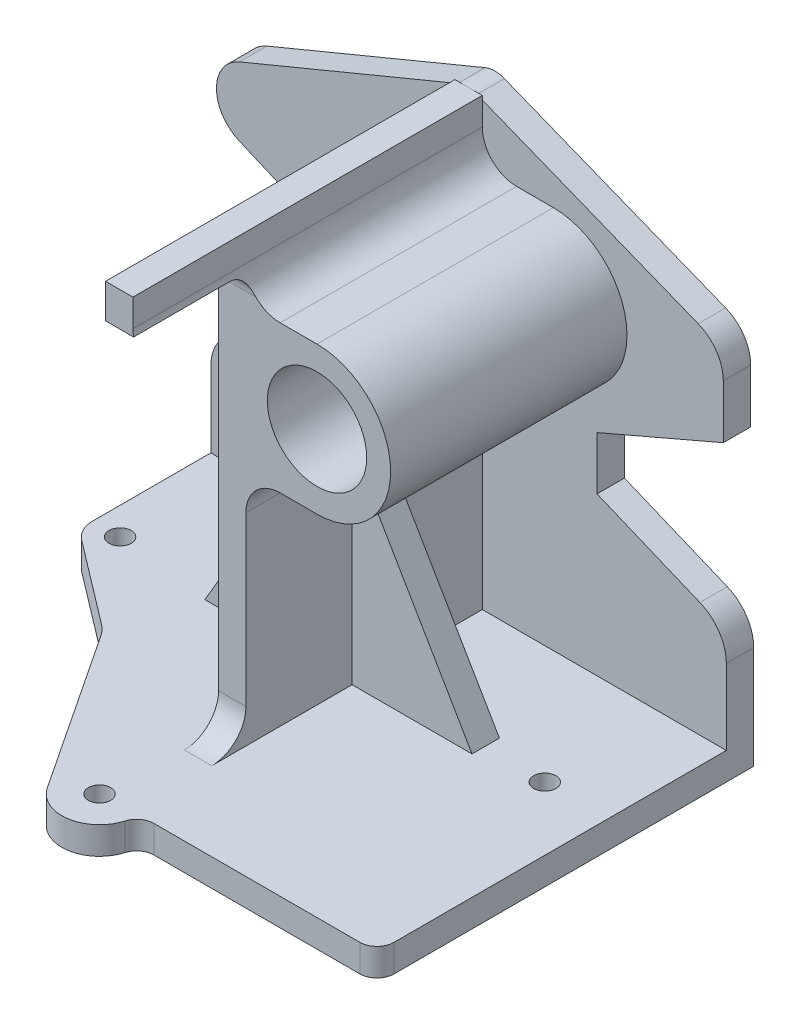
ISO-10303-21;
HEADER;
FILE_DESCRIPTION(('STEP AP214'),'2;1');
FILE_NAME('part.step','',(''),(''),'','','');
FILE_SCHEMA(('AUTOMOTIVE_DESIGN { 1 0 10303 214 1 1 1 1 }'));
ENDSEC;
DATA;
#1=APPLICATION_CONTEXT('core data for automotive mechanical design processes');
#2=APPLICATION_PROTOCOL_DEFINITION('international standard','automotive_design',2000,#1);
#3=PRODUCT_CONTEXT('',#1,'mechanical');
#4=PRODUCT('Part','Part','',(#3));
#5=PRODUCT_RELATED_PRODUCT_CATEGORY('part','',(#4));
#6=PRODUCT_DEFINITION_FORMATION('','',#4);
#7=PRODUCT_DEFINITION_CONTEXT('part definition',#1,'design');
#8=PRODUCT_DEFINITION('design','',#6,#7);
#9=PRODUCT_DEFINITION_SHAPE('','',#8);
#10=(LENGTH_UNIT() NAMED_UNIT(*) SI_UNIT(.MILLI.,.METRE.));
#11=(NAMED_UNIT(*) PLANE_ANGLE_UNIT() SI_UNIT($,.RADIAN.));
#12=(NAMED_UNIT(*) SI_UNIT($,.STERADIAN.) SOLID_ANGLE_UNIT());
#13=UNCERTAINTY_MEASURE_WITH_UNIT(LENGTH_MEASURE(1.E-05),#10,'distance_accuracy_value','');
#14=(GEOMETRIC_REPRESENTATION_CONTEXT(3) GLOBAL_UNCERTAINTY_ASSIGNED_CONTEXT((#13)) GLOBAL_UNIT_ASSIGNED_CONTEXT((#10,
#11,#12)) REPRESENTATION_CONTEXT('',''));
#15=CARTESIAN_POINT('',(0.,0.,0.));
#16=DIRECTION('',(0.,0.,1.));
#17=DIRECTION('',(1.,0.,0.));
#18=AXIS2_PLACEMENT_3D('',#15,#16,#17);
#19=CARTESIAN_POINT('',(8.,36.,174.));
#20=DIRECTION('',(1.,0.,0.));
#21=DIRECTION('',(0.,0.,-1.));
#22=AXIS2_PLACEMENT_3D('',#19,#20,#21);
#23=PLANE('',#22);
#24=DIRECTION('',(0.,0.,-1.));
#25=VECTOR('',#24,1.);
#26=CARTESIAN_POINT('',(8.,134.,174.));
#27=LINE('',#26,#25);
#28=CARTESIAN_POINT('',(8.,134.,16.));
#29=VERTEX_POINT('',#28);
#30=CARTESIAN_POINT('',(8.,134.,76.));
#31=VERTEX_POINT('',#30);
#32=EDGE_CURVE('E689',#29,#31,#27,.F.);
#33=ORIENTED_EDGE('',*,*,#32,.T.);
#34=DIRECTION('',(0.,-1.,0.));
#35=VECTOR('',#34,1.);
#36=CARTESIAN_POINT('',(8.,36.,76.));
#37=LINE('',#36,#35);
#38=CARTESIAN_POINT('',(8.,16.,76.));
#39=VERTEX_POINT('',#38);
#40=EDGE_CURVE('E380',#31,#39,#37,.T.);
#41=ORIENTED_EDGE('',*,*,#40,.T.);
#42=DIRECTION('',(0.,0.,1.));
#43=VECTOR('',#42,1.);
#44=CARTESIAN_POINT('',(8.,16.,16.));
#45=LINE('',#44,#43);
#46=CARTESIAN_POINT('',(8.,16.,16.));
#47=VERTEX_POINT('',#46);
#48=EDGE_CURVE('E449',#47,#39,#45,.T.);
#49=ORIENTED_EDGE('',*,*,#48,.F.);
#50=DIRECTION('',(0.,-1.,0.));
#51=VECTOR('',#50,1.);
#52=CARTESIAN_POINT('',(8.,276.,16.));
#53=LINE('',#52,#51);
#54=EDGE_CURVE('E443',#29,#47,#53,.T.);
#55=ORIENTED_EDGE('',*,*,#54,.F.);
#56=EDGE_LOOP('',(#33,#41,#49,#55));
#57=FACE_BOUND('',#56,.T.);
#58=ADVANCED_FACE('F36',(#57),#23,.T.);
#59=CARTESIAN_POINT('',(125.5,202.,16.));
#60=DIRECTION('',(0.,0.,1.));
#61=DIRECTION('',(1.,0.,0.));
#62=AXIS2_PLACEMENT_3D('',#59,#60,#61);
#63=PLANE('',#62);
#64=CARTESIAN_POINT('',(8.,273.707548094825,16.));
#65=VERTEX_POINT('',#64);
#66=CARTESIAN_POINT('',(8.,260.,16.));
#67=VERTEX_POINT('',#66);
#68=EDGE_CURVE('E448',#65,#67,#53,.T.);
#69=ORIENTED_EDGE('',*,*,#68,.T.);
#70=CARTESIAN_POINT('',(28.,260.,16.));
#71=DIRECTION('',(0.,0.,1.));
#72=DIRECTION('',(1.,0.,0.));
#73=AXIS2_PLACEMENT_3D('',#70,#71,#72);
#74=CIRCLE('',#73,20.);
#75=CARTESIAN_POINT('',(28.,240.,16.));
#76=VERTEX_POINT('',#75);
#77=EDGE_CURVE('E682',#67,#76,#74,.T.);
#78=ORIENTED_EDGE('',*,*,#77,.T.);
#79=DIRECTION('',(-1.,0.,0.));
#80=VECTOR('',#79,1.);
#81=CARTESIAN_POINT('',(49.5,240.,16.));
#82=LINE('',#81,#80);
#83=CARTESIAN_POINT('',(49.5,240.,16.));
#84=VERTEX_POINT('',#83);
#85=EDGE_CURVE('E402',#84,#76,#82,.T.);
#86=ORIENTED_EDGE('',*,*,#85,.F.);
#87=CARTESIAN_POINT('',(49.5,197.,16.));
#88=DIRECTION('',(0.,0.,1.));
#89=DIRECTION('',(1.,0.,0.));
#90=AXIS2_PLACEMENT_3D('',#87,#88,#89);
#91=CIRCLE('',#90,43.);
#92=CARTESIAN_POINT('',(49.5,154.,16.));
#93=VERTEX_POINT('',#92);
#94=EDGE_CURVE('E399',#93,#84,#91,.T.);
#95=ORIENTED_EDGE('',*,*,#94,.F.);
#96=DIRECTION('',(1.,0.,0.));
#97=VECTOR('',#96,1.);
#98=CARTESIAN_POINT('',(8.,154.,16.));
#99=LINE('',#98,#97);
#100=CARTESIAN_POINT('',(28.,154.,16.));
#101=VERTEX_POINT('',#100);
#102=EDGE_CURVE('E405',#101,#93,#99,.T.);
#103=ORIENTED_EDGE('',*,*,#102,.F.);
#104=CARTESIAN_POINT('',(28.,134.,16.));
#105=DIRECTION('',(0.,0.,1.));
#106=DIRECTION('',(1.,0.,0.));
#107=AXIS2_PLACEMENT_3D('',#104,#105,#106);
#108=CIRCLE('',#107,20.);
#109=EDGE_CURVE('E680',#101,#29,#108,.T.);
#110=ORIENTED_EDGE('',*,*,#109,.T.);
#111=ORIENTED_EDGE('',*,*,#54,.T.);
#112=DIRECTION('',(-1.,0.,0.));
#113=VECTOR('',#112,1.);
#114=CARTESIAN_POINT('',(125.5,16.,16.));
#115=LINE('',#114,#113);
#116=CARTESIAN_POINT('',(150.5,16.,16.));
#117=VERTEX_POINT('',#116);
#118=EDGE_CURVE('E548',#117,#47,#115,.T.);
#119=ORIENTED_EDGE('',*,*,#118,.F.);
#120=DIRECTION('',(0.,1.,0.));
#121=VECTOR('',#120,1.);
#122=CARTESIAN_POINT('',(150.5,0.,16.));
#123=LINE('',#122,#121);
#124=CARTESIAN_POINT('',(150.5,60.,16.));
#125=VERTEX_POINT('',#124);
#126=EDGE_CURVE('E623',#117,#125,#123,.T.);
#127=ORIENTED_EDGE('',*,*,#126,.T.);
#128=CARTESIAN_POINT('',(125.5,60.,16.));
#129=DIRECTION('',(0.,0.,1.));
#130=DIRECTION('',(1.,0.,0.));
#131=AXIS2_PLACEMENT_3D('',#128,#129,#130);
#132=CIRCLE('',#131,25.);
#133=CARTESIAN_POINT('',(135.074439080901,83.0939411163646,16.));
#134=VERTEX_POINT('',#133);
#135=EDGE_CURVE('E625',#125,#134,#132,.T.);
#136=ORIENTED_EDGE('',*,*,#135,.T.);
#137=DIRECTION('',(-0.923757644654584,0.382977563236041,0.));
#138=VECTOR('',#137,1.);
#139=CARTESIAN_POINT('',(135.074439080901,83.0939411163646,16.));
#140=LINE('',#139,#138);
#141=CARTESIAN_POINT('',(75.0000000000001,108.,16.));
#142=VERTEX_POINT('',#141);
#143=EDGE_CURVE('E627',#134,#142,#140,.T.);
#144=ORIENTED_EDGE('',*,*,#143,.T.);
#145=DIRECTION('',(0.,-1.,0.));
#146=VECTOR('',#145,1.);
#147=CARTESIAN_POINT('',(75.0000000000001,139.,16.));
#148=LINE('',#147,#146);
#149=CARTESIAN_POINT('',(75.0000000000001,139.,16.));
#150=VERTEX_POINT('',#149);
#151=EDGE_CURVE('E629',#150,#142,#148,.T.);
#152=ORIENTED_EDGE('',*,*,#151,.F.);
#153=DIRECTION('',(-0.918518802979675,-0.395377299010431,0.));
#154=VECTOR('',#153,1.);
#155=CARTESIAN_POINT('',(148.730308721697,170.737282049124,16.));
#156=LINE('',#155,#154);
#157=CARTESIAN_POINT('',(148.730308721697,170.737282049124,16.));
#158=VERTEX_POINT('',#157);
#159=EDGE_CURVE('E632',#158,#150,#156,.T.);
#160=ORIENTED_EDGE('',*,*,#159,.F.);
#161=DIRECTION('',(0.,1.,0.));
#162=VECTOR('',#161,1.);
#163=CARTESIAN_POINT('',(148.730308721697,170.737282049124,16.));
#164=LINE('',#163,#162);
#165=CARTESIAN_POINT('',(148.730308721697,202.,16.));
#166=VERTEX_POINT('',#165);
#167=EDGE_CURVE('E635',#158,#166,#164,.T.);
#168=ORIENTED_EDGE('',*,*,#167,.T.);
#169=CARTESIAN_POINT('',(125.5,202.,16.));
#170=DIRECTION('',(0.,0.,1.));
#171=DIRECTION('',(1.,0.,0.));
#172=AXIS2_PLACEMENT_3D('',#169,#170,#171);
#173=CIRCLE('',#172,23.2303087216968);
#174=CARTESIAN_POINT('',(134.08141915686,223.58718343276,16.));
#175=VERTEX_POINT('',#174);
#176=EDGE_CURVE('E596',#166,#175,#173,.T.);
#177=ORIENTED_EDGE('',*,*,#176,.T.);
#178=DIRECTION('',(0.929268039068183,-0.369406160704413,0.));
#179=VECTOR('',#178,1.);
#180=CARTESIAN_POINT('',(4.90214146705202,274.939020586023,16.));
#181=LINE('',#180,#179);
#182=EDGE_CURVE('E599',#65,#175,#181,.T.);
#183=ORIENTED_EDGE('',*,*,#182,.F.);
#184=EDGE_LOOP('',(#69,#78,#86,#95,#103,#110,#111,#119,#127,#136,#144,#152,#160,#168,#177,#183));
#185=FACE_BOUND('',#184,.T.);
#186=ADVANCED_FACE('F776',(#185),#63,.T.);
#187=DIRECTION('',(0.,1.,0.));
#188=VECTOR('',#187,1.);
#189=CARTESIAN_POINT('',(8.,256.,220.));
#190=LINE('',#189,#188);
#191=CARTESIAN_POINT('',(8.,260.,220.));
#192=VERTEX_POINT('',#191);
#193=CARTESIAN_POINT('',(8.,276.,220.));
#194=VERTEX_POINT('',#193);
#195=EDGE_CURVE('E457',#192,#194,#190,.T.);
#196=ORIENTED_EDGE('',*,*,#195,.F.);
#197=DIRECTION('',(0.,0.,-1.));
#198=VECTOR('',#197,1.);
#199=CARTESIAN_POINT('',(8.,260.,174.));
#200=LINE('',#199,#198);
#201=EDGE_CURVE('E677',#192,#67,#200,.T.);
#202=ORIENTED_EDGE('',*,*,#201,.T.);
#203=ORIENTED_EDGE('',*,*,#68,.F.);
#204=CARTESIAN_POINT('',(8.,276.,16.));
#205=VERTEX_POINT('',#204);
#206=EDGE_CURVE('E444',#205,#65,#53,.T.);
#207=ORIENTED_EDGE('',*,*,#206,.F.);
#208=DIRECTION('',(0.,0.,-1.));
#209=VECTOR('',#208,1.);
#210=CARTESIAN_POINT('',(8.,276.,220.));
#211=LINE('',#210,#209);
#212=EDGE_CURVE('E440',#194,#205,#211,.T.);
#213=ORIENTED_EDGE('',*,*,#212,.F.);
#214=EDGE_LOOP('',(#196,#202,#203,#207,#213));
#215=FACE_BOUND('',#214,.T.);
#216=ADVANCED_FACE('F779',(#215),#23,.T.);
#217=DIRECTION('',(0.,-1.,0.));
#218=VECTOR('',#217,1.);
#219=CARTESIAN_POINT('',(8.,36.,92.));
#220=LINE('',#219,#218);
#221=CARTESIAN_POINT('',(8.,134.,92.));
#222=VERTEX_POINT('',#221);
#223=CARTESIAN_POINT('',(8.,16.,92.));
#224=VERTEX_POINT('',#223);
#225=EDGE_CURVE('E384',#222,#224,#220,.T.);
#226=ORIENTED_EDGE('',*,*,#225,.F.);
#227=CARTESIAN_POINT('',(8.,134.,154.));
#228=VERTEX_POINT('',#227);
#229=EDGE_CURVE('E688',#222,#228,#27,.F.);
#230=ORIENTED_EDGE('',*,*,#229,.T.);
#231=DIRECTION('',(0.,-1.,0.));
#232=VECTOR('',#231,1.);
#233=CARTESIAN_POINT('',(8.,246.,154.));
#234=LINE('',#233,#232);
#235=CARTESIAN_POINT('',(8.,36.,154.));
#236=VERTEX_POINT('',#235);
#237=EDGE_CURVE('E455',#228,#236,#234,.T.);
#238=ORIENTED_EDGE('',*,*,#237,.T.);
#239=CARTESIAN_POINT('',(8.,36.,174.));
#240=DIRECTION('',(1.,0.,0.));
#241=DIRECTION('',(0.,0.,-1.));
#242=AXIS2_PLACEMENT_3D('',#239,#240,#241);
#243=CIRCLE('',#242,20.);
#244=CARTESIAN_POINT('',(8.,16.,174.));
#245=VERTEX_POINT('',#244);
#246=EDGE_CURVE('E452',#245,#236,#243,.T.);
#247=ORIENTED_EDGE('',*,*,#246,.F.);
#248=EDGE_CURVE('E447',#224,#245,#45,.T.);
#249=ORIENTED_EDGE('',*,*,#248,.F.);
#250=EDGE_LOOP('',(#226,#230,#238,#247,#249));
#251=FACE_BOUND('',#250,.T.);
#252=ADVANCED_FACE('F851',(#251),#23,.T.);
#253=CARTESIAN_POINT('',(-8.00000000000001,16.,16.));
#254=VERTEX_POINT('',#253);
#255=CARTESIAN_POINT('',(-150.500000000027,16.,16.));
#256=VERTEX_POINT('',#255);
#257=EDGE_CURVE('E547',#254,#256,#115,.T.);
#258=ORIENTED_EDGE('',*,*,#257,.F.);
#259=DIRECTION('',(0.,-1.,0.));
#260=VECTOR('',#259,1.);
#261=CARTESIAN_POINT('',(-8.,276.,16.));
#262=LINE('',#261,#260);
#263=CARTESIAN_POINT('',(-8.,274.18651380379,16.));
#264=VERTEX_POINT('',#263);
#265=EDGE_CURVE('E349',#264,#254,#262,.T.);
#266=ORIENTED_EDGE('',*,*,#265,.F.);
#267=DIRECTION('',(-0.923814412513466,-0.382840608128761,0.));
#268=VECTOR('',#267,1.);
#269=CARTESIAN_POINT('',(-6.38156006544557,274.857216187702,16.));
#270=LINE('',#269,#268);
#271=CARTESIAN_POINT('',(-133.808854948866,222.049701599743,16.));
#272=VERTEX_POINT('',#271);
#273=EDGE_CURVE('E605',#264,#272,#270,.T.);
#274=ORIENTED_EDGE('',*,*,#273,.T.);
#275=CARTESIAN_POINT('',(-125.5,202.,16.));
#276=DIRECTION('',(0.,0.,1.));
#277=DIRECTION('',(1.,0.,0.));
#278=AXIS2_PLACEMENT_3D('',#275,#276,#277);
#279=CIRCLE('',#278,21.7031703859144);
#280=CARTESIAN_POINT('',(-134.0733203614,182.061951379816,16.));
#281=VERTEX_POINT('',#280);
#282=EDGE_CURVE('E608',#272,#281,#279,.T.);
#283=ORIENTED_EDGE('',*,*,#282,.T.);
#284=DIRECTION('',(-0.918669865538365,0.39502617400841,0.));
#285=VECTOR('',#284,1.);
#286=CARTESIAN_POINT('',(-75.,156.660543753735,16.));
#287=LINE('',#286,#285);
#288=CARTESIAN_POINT('',(-75.,156.660543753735,16.));
#289=VERTEX_POINT('',#288);
#290=EDGE_CURVE('E610',#289,#281,#287,.T.);
#291=ORIENTED_EDGE('',*,*,#290,.F.);
#292=DIRECTION('',(0.,-1.,0.));
#293=VECTOR('',#292,1.);
#294=CARTESIAN_POINT('',(-75.,156.660543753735,16.));
#295=LINE('',#294,#293);
#296=CARTESIAN_POINT('',(-75.,108.,16.));
#297=VERTEX_POINT('',#296);
#298=EDGE_CURVE('E613',#289,#297,#295,.T.);
#299=ORIENTED_EDGE('',*,*,#298,.T.);
#300=DIRECTION('',(0.923757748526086,0.382977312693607,0.));
#301=VECTOR('',#300,1.);
#302=CARTESIAN_POINT('',(-135.074415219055,83.0939701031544,16.));
#303=LINE('',#302,#301);
#304=CARTESIAN_POINT('',(-135.074415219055,83.0939701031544,16.));
#305=VERTEX_POINT('',#304);
#306=EDGE_CURVE('E615',#305,#297,#303,.T.);
#307=ORIENTED_EDGE('',*,*,#306,.F.);
#308=CARTESIAN_POINT('',(-125.499971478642,60.0000000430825,16.));
#309=DIRECTION('',(0.,0.,1.));
#310=DIRECTION('',(1.,0.,0.));
#311=AXIS2_PLACEMENT_3D('',#308,#309,#310);
#312=CIRCLE('',#311,25.0000285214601);
#313=CARTESIAN_POINT('',(-150.500000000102,60.0000000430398,16.));
#314=VERTEX_POINT('',#313);
#315=EDGE_CURVE('E618',#305,#314,#312,.T.);
#316=ORIENTED_EDGE('',*,*,#315,.T.);
#317=DIRECTION('',(-1.70696789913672E-12,1.,0.));
#318=VECTOR('',#317,1.);
#319=CARTESIAN_POINT('',(-150.5,0.,16.));
#320=LINE('',#319,#318);
#321=EDGE_CURVE('E621',#256,#314,#320,.T.);
#322=ORIENTED_EDGE('',*,*,#321,.F.);
#323=EDGE_LOOP('',(#258,#266,#274,#283,#291,#299,#307,#316,#322));
#324=FACE_BOUND('',#323,.T.);
#325=ADVANCED_FACE('F781',(#324),#63,.T.);
#326=CARTESIAN_POINT('',(125.5,202.,16.));
#327=DIRECTION('',(0.,0.,-1.));
#328=DIRECTION('',(-1.,0.,0.));
#329=AXIS2_PLACEMENT_3D('',#326,#327,#328);
#330=CYLINDRICAL_SURFACE('',#329,23.2303087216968);
#331=CARTESIAN_POINT('',(125.5,202.,0.));
#332=DIRECTION('',(0.,0.,1.));
#333=DIRECTION('',(1.,0.,0.));
#334=AXIS2_PLACEMENT_3D('',#331,#332,#333);
#335=CIRCLE('',#334,23.2303087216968);
#336=CARTESIAN_POINT('',(148.730308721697,202.,0.));
#337=VERTEX_POINT('',#336);
#338=CARTESIAN_POINT('',(134.08141915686,223.58718343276,0.));
#339=VERTEX_POINT('',#338);
#340=EDGE_CURVE('E551',#337,#339,#335,.T.);
#341=ORIENTED_EDGE('',*,*,#340,.T.);
#342=DIRECTION('',(0.,0.,-1.));
#343=VECTOR('',#342,1.);
#344=CARTESIAN_POINT('',(134.08141915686,223.58718343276,16.));
#345=LINE('',#344,#343);
#346=EDGE_CURVE('E675',#175,#339,#345,.T.);
#347=ORIENTED_EDGE('',*,*,#346,.F.);
#348=ORIENTED_EDGE('',*,*,#176,.F.);
#349=DIRECTION('',(0.,0.,-1.));
#350=VECTOR('',#349,1.);
#351=CARTESIAN_POINT('',(148.730308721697,202.,16.));
#352=LINE('',#351,#350);
#353=EDGE_CURVE('E637',#166,#337,#352,.T.);
#354=ORIENTED_EDGE('',*,*,#353,.T.);
#355=EDGE_LOOP('',(#341,#347,#348,#354));
#356=FACE_BOUND('',#355,.T.);
#357=ADVANCED_FACE('F38',(#356),#330,.T.);
#358=CARTESIAN_POINT('',(4.90214146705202,274.939020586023,16.));
#359=DIRECTION('',(0.369406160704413,0.929268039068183,0.));
#360=DIRECTION('',(-0.929268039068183,0.369406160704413,0.));
#361=AXIS2_PLACEMENT_3D('',#358,#359,#360);
#362=PLANE('',#361);
#363=DIRECTION('',(0.929268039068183,-0.369406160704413,0.));
#364=VECTOR('',#363,1.);
#365=CARTESIAN_POINT('',(4.90214146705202,274.939020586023,0.));
#366=LINE('',#365,#364);
#367=CARTESIAN_POINT('',(4.90214146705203,274.939020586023,0.));
#368=VERTEX_POINT('',#367);
#369=EDGE_CURVE('E554',#368,#339,#366,.T.);
#370=ORIENTED_EDGE('',*,*,#369,.F.);
#371=DIRECTION('',(0.,0.,-1.));
#372=VECTOR('',#371,1.);
#373=CARTESIAN_POINT('',(4.90214146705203,274.939020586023,16.));
#374=LINE('',#373,#372);
#375=CARTESIAN_POINT('',(4.90214146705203,274.939020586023,16.));
#376=VERTEX_POINT('',#375);
#377=EDGE_CURVE('E673',#376,#368,#374,.T.);
#378=ORIENTED_EDGE('',*,*,#377,.F.);
#379=EDGE_CURVE('E600',#376,#65,#181,.T.);
#380=ORIENTED_EDGE('',*,*,#379,.T.);
#381=ORIENTED_EDGE('',*,*,#182,.T.);
#382=ORIENTED_EDGE('',*,*,#346,.T.);
#383=EDGE_LOOP('',(#370,#378,#380,#381,#382));
#384=FACE_BOUND('',#383,.T.);
#385=ADVANCED_FACE('F839',(#384),#362,.T.);
#386=CARTESIAN_POINT('',(-0.638950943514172,261.,16.));
#387=DIRECTION('',(0.,0.,-1.));
#388=DIRECTION('',(-1.,0.,0.));
#389=AXIS2_PLACEMENT_3D('',#386,#387,#388);
#390=CYLINDRICAL_SURFACE('',#389,15.);
#391=CARTESIAN_POINT('',(-0.638950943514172,261.,0.));
#392=DIRECTION('',(0.,0.,1.));
#393=DIRECTION('',(1.,0.,0.));
#394=AXIS2_PLACEMENT_3D('',#391,#392,#393);
#395=CIRCLE('',#394,15.);
#396=CARTESIAN_POINT('',(-6.38156006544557,274.857216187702,0.));
#397=VERTEX_POINT('',#396);
#398=EDGE_CURVE('E557',#368,#397,#395,.T.);
#399=ORIENTED_EDGE('',*,*,#398,.T.);
#400=DIRECTION('',(0.,0.,-1.));
#401=VECTOR('',#400,1.);
#402=CARTESIAN_POINT('',(-6.38156006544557,274.857216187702,16.));
#403=LINE('',#402,#401);
#404=CARTESIAN_POINT('',(-6.38156006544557,274.857216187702,16.));
#405=VERTEX_POINT('',#404);
#406=EDGE_CURVE('E670',#405,#397,#403,.T.);
#407=ORIENTED_EDGE('',*,*,#406,.F.);
#408=CARTESIAN_POINT('',(-0.638950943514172,261.,16.));
#409=DIRECTION('',(0.,0.,-1.));
#410=DIRECTION('',(0.,1.,0.));
#411=AXIS2_PLACEMENT_3D('',#408,#409,#410);
#412=CIRCLE('',#411,15.);
#413=CARTESIAN_POINT('',(-0.638950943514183,276.,16.));
#414=VERTEX_POINT('',#413);
#415=EDGE_CURVE('E462',#405,#414,#412,.T.);
#416=ORIENTED_EDGE('',*,*,#415,.T.);
#417=CARTESIAN_POINT('',(-0.638950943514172,261.,16.));
#418=DIRECTION('',(0.,0.,1.));
#419=DIRECTION('',(1.,0.,0.));
#420=AXIS2_PLACEMENT_3D('',#417,#418,#419);
#421=CIRCLE('',#420,15.);
#422=EDGE_CURVE('E603',#376,#414,#421,.T.);
#423=ORIENTED_EDGE('',*,*,#422,.F.);
#424=ORIENTED_EDGE('',*,*,#377,.T.);
#425=EDGE_LOOP('',(#399,#407,#416,#423,#424));
#426=FACE_BOUND('',#425,.T.);
#427=ADVANCED_FACE('F836',(#426),#390,.T.);
#428=CARTESIAN_POINT('',(-6.38156006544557,274.857216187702,16.));
#429=DIRECTION('',(0.382840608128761,-0.923814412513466,0.));
#430=DIRECTION('',(0.923814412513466,0.382840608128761,0.));
#431=AXIS2_PLACEMENT_3D('',#428,#429,#430);
#432=PLANE('',#431);
#433=DIRECTION('',(-0.923814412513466,-0.382840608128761,0.));
#434=VECTOR('',#433,1.);
#435=CARTESIAN_POINT('',(-6.38156006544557,274.857216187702,0.));
#436=LINE('',#435,#434);
#437=CARTESIAN_POINT('',(-133.808854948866,222.049701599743,0.));
#438=VERTEX_POINT('',#437);
#439=EDGE_CURVE('E559',#397,#438,#436,.T.);
#440=ORIENTED_EDGE('',*,*,#439,.T.);
#441=DIRECTION('',(0.,0.,-1.));
#442=VECTOR('',#441,1.);
#443=CARTESIAN_POINT('',(-133.808854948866,222.049701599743,16.));
#444=LINE('',#443,#442);
#445=EDGE_CURVE('E667',#272,#438,#444,.T.);
#446=ORIENTED_EDGE('',*,*,#445,.F.);
#447=ORIENTED_EDGE('',*,*,#273,.F.);
#448=EDGE_CURVE('E606',#405,#264,#270,.T.);
#449=ORIENTED_EDGE('',*,*,#448,.F.);
#450=ORIENTED_EDGE('',*,*,#406,.T.);
#451=EDGE_LOOP('',(#440,#446,#447,#449,#450));
#452=FACE_BOUND('',#451,.T.);
#453=ADVANCED_FACE('F832',(#452),#432,.F.);
#454=CARTESIAN_POINT('',(-125.5,202.,16.));
#455=DIRECTION('',(0.,0.,-1.));
#456=DIRECTION('',(-1.,0.,0.));
#457=AXIS2_PLACEMENT_3D('',#454,#455,#456);
#458=CYLINDRICAL_SURFACE('',#457,21.7031703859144);
#459=CARTESIAN_POINT('',(-125.5,202.,0.));
#460=DIRECTION('',(0.,0.,1.));
#461=DIRECTION('',(1.,0.,0.));
#462=AXIS2_PLACEMENT_3D('',#459,#460,#461);
#463=CIRCLE('',#462,21.7031703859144);
#464=CARTESIAN_POINT('',(-134.0733203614,182.061951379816,0.));
#465=VERTEX_POINT('',#464);
#466=EDGE_CURVE('E561',#438,#465,#463,.T.);
#467=ORIENTED_EDGE('',*,*,#466,.T.);
#468=DIRECTION('',(0.,0.,-1.));
#469=VECTOR('',#468,1.);
#470=CARTESIAN_POINT('',(-134.0733203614,182.061951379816,16.));
#471=LINE('',#470,#469);
#472=EDGE_CURVE('E665',#281,#465,#471,.T.);
#473=ORIENTED_EDGE('',*,*,#472,.F.);
#474=ORIENTED_EDGE('',*,*,#282,.F.);
#475=ORIENTED_EDGE('',*,*,#445,.T.);
#476=EDGE_LOOP('',(#467,#473,#474,#475));
#477=FACE_BOUND('',#476,.T.);
#478=ADVANCED_FACE('F828',(#477),#458,.T.);
#479=CARTESIAN_POINT('',(-75.,156.660543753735,16.));
#480=DIRECTION('',(-0.39502617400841,-0.918669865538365,0.));
#481=DIRECTION('',(0.918669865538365,-0.39502617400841,0.));
#482=AXIS2_PLACEMENT_3D('',#479,#480,#481);
#483=PLANE('',#482);
#484=DIRECTION('',(-0.918669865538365,0.39502617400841,0.));
#485=VECTOR('',#484,1.);
#486=CARTESIAN_POINT('',(-75.,156.660543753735,0.));
#487=LINE('',#486,#485);
#488=CARTESIAN_POINT('',(-75.,156.660543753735,0.));
#489=VERTEX_POINT('',#488);
#490=EDGE_CURVE('E564',#489,#465,#487,.T.);
#491=ORIENTED_EDGE('',*,*,#490,.F.);
#492=DIRECTION('',(0.,0.,-1.));
#493=VECTOR('',#492,1.);
#494=CARTESIAN_POINT('',(-75.,156.660543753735,16.));
#495=LINE('',#494,#493);
#496=EDGE_CURVE('E663',#289,#489,#495,.T.);
#497=ORIENTED_EDGE('',*,*,#496,.F.);
#498=ORIENTED_EDGE('',*,*,#290,.T.);
#499=ORIENTED_EDGE('',*,*,#472,.T.);
#500=EDGE_LOOP('',(#491,#497,#498,#499));
#501=FACE_BOUND('',#500,.T.);
#502=ADVANCED_FACE('F824',(#501),#483,.T.);
#503=CARTESIAN_POINT('',(-75.,156.660543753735,16.));
#504=DIRECTION('',(1.,0.,0.));
#505=DIRECTION('',(0.,0.,-1.));
#506=AXIS2_PLACEMENT_3D('',#503,#504,#505);
#507=PLANE('',#506);
#508=DIRECTION('',(0.,-1.,0.));
#509=VECTOR('',#508,1.);
#510=CARTESIAN_POINT('',(-75.,156.660543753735,0.));
#511=LINE('',#510,#509);
#512=CARTESIAN_POINT('',(-75.,108.,0.));
#513=VERTEX_POINT('',#512);
#514=EDGE_CURVE('E567',#489,#513,#511,.T.);
#515=ORIENTED_EDGE('',*,*,#514,.T.);
#516=DIRECTION('',(0.,0.,-1.));
#517=VECTOR('',#516,1.);
#518=CARTESIAN_POINT('',(-75.,108.,16.));
#519=LINE('',#518,#517);
#520=EDGE_CURVE('E661',#297,#513,#519,.T.);
#521=ORIENTED_EDGE('',*,*,#520,.F.);
#522=ORIENTED_EDGE('',*,*,#298,.F.);
#523=ORIENTED_EDGE('',*,*,#496,.T.);
#524=EDGE_LOOP('',(#515,#521,#522,#523));
#525=FACE_BOUND('',#524,.T.);
#526=ADVANCED_FACE('F820',(#525),#507,.F.);
#527=CARTESIAN_POINT('',(-135.074415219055,83.0939701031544,16.));
#528=DIRECTION('',(-0.382977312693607,0.923757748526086,0.));
#529=DIRECTION('',(-0.923757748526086,-0.382977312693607,0.));
#530=AXIS2_PLACEMENT_3D('',#527,#528,#529);
#531=PLANE('',#530);
#532=DIRECTION('',(0.923757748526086,0.382977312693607,0.));
#533=VECTOR('',#532,1.);
#534=CARTESIAN_POINT('',(-135.074415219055,83.0939701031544,0.));
#535=LINE('',#534,#533);
#536=CARTESIAN_POINT('',(-135.074415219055,83.0939701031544,0.));
#537=VERTEX_POINT('',#536);
#538=EDGE_CURVE('E570',#537,#513,#535,.T.);
#539=ORIENTED_EDGE('',*,*,#538,.F.);
#540=DIRECTION('',(0.,0.,-1.));
#541=VECTOR('',#540,1.);
#542=CARTESIAN_POINT('',(-135.074415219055,83.0939701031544,16.));
#543=LINE('',#542,#541);
#544=EDGE_CURVE('E659',#305,#537,#543,.T.);
#545=ORIENTED_EDGE('',*,*,#544,.F.);
#546=ORIENTED_EDGE('',*,*,#306,.T.);
#547=ORIENTED_EDGE('',*,*,#520,.T.);
#548=EDGE_LOOP('',(#539,#545,#546,#547));
#549=FACE_BOUND('',#548,.T.);
#550=ADVANCED_FACE('F816',(#549),#531,.T.);
#551=CARTESIAN_POINT('',(-125.499971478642,60.0000000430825,16.));
#552=DIRECTION('',(0.,0.,-1.));
#553=DIRECTION('',(-1.,0.,0.));
#554=AXIS2_PLACEMENT_3D('',#551,#552,#553);
#555=CYLINDRICAL_SURFACE('',#554,25.0000285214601);
#556=CARTESIAN_POINT('',(-125.499971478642,60.0000000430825,0.));
#557=DIRECTION('',(0.,0.,1.));
#558=DIRECTION('',(1.,0.,0.));
#559=AXIS2_PLACEMENT_3D('',#556,#557,#558);
#560=CIRCLE('',#559,25.0000285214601);
#561=CARTESIAN_POINT('',(-150.500000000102,60.0000000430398,0.));
#562=VERTEX_POINT('',#561);
#563=EDGE_CURVE('E573',#537,#562,#560,.T.);
#564=ORIENTED_EDGE('',*,*,#563,.T.);
#565=DIRECTION('',(0.,0.,-1.));
#566=VECTOR('',#565,1.);
#567=CARTESIAN_POINT('',(-150.500000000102,60.0000000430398,16.));
#568=LINE('',#567,#566);
#569=EDGE_CURVE('E656',#314,#562,#568,.T.);
#570=ORIENTED_EDGE('',*,*,#569,.F.);
#571=ORIENTED_EDGE('',*,*,#315,.F.);
#572=ORIENTED_EDGE('',*,*,#544,.T.);
#573=EDGE_LOOP('',(#564,#570,#571,#572));
#574=FACE_BOUND('',#573,.T.);
#575=ADVANCED_FACE('F812',(#574),#555,.T.);
#576=CARTESIAN_POINT('',(-150.5,0.,16.));
#577=DIRECTION('',(-1.,-1.70696789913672E-12,0.));
#578=DIRECTION('',(1.70696789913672E-12,-1.,0.));
#579=AXIS2_PLACEMENT_3D('',#576,#577,#578);
#580=PLANE('',#579);
#581=DIRECTION('',(0.,-1.,0.));
#582=VECTOR('',#581,1.);
#583=CARTESIAN_POINT('',(-150.5,16.,85.));
#584=LINE('',#583,#582);
#585=CARTESIAN_POINT('',(-150.5,16.,85.));
#586=VERTEX_POINT('',#585);
#587=CARTESIAN_POINT('',(-150.5,0.,85.));
#588=VERTEX_POINT('',#587);
#589=EDGE_CURVE('E544',#586,#588,#584,.T.);
#590=ORIENTED_EDGE('',*,*,#589,.F.);
#591=DIRECTION('',(0.,0.,1.));
#592=VECTOR('',#591,1.);
#593=CARTESIAN_POINT('',(-150.5,16.,0.));
#594=LINE('',#593,#592);
#595=EDGE_CURVE('E502',#256,#586,#594,.T.);
#596=ORIENTED_EDGE('',*,*,#595,.F.);
#597=ORIENTED_EDGE('',*,*,#321,.T.);
#598=ORIENTED_EDGE('',*,*,#569,.T.);
#599=DIRECTION('',(-1.70696789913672E-12,1.,0.));
#600=VECTOR('',#599,1.);
#601=CARTESIAN_POINT('',(-150.5,0.,0.));
#602=LINE('',#601,#600);
#603=CARTESIAN_POINT('',(-150.5,0.,0.));
#604=VERTEX_POINT('',#603);
#605=EDGE_CURVE('E576',#604,#562,#602,.T.);
#606=ORIENTED_EDGE('',*,*,#605,.F.);
#607=DIRECTION('',(0.,0.,-1.));
#608=VECTOR('',#607,1.);
#609=CARTESIAN_POINT('',(-150.5,0.,16.));
#610=LINE('',#609,#608);
#611=EDGE_CURVE('E654',#588,#604,#610,.T.);
#612=ORIENTED_EDGE('',*,*,#611,.F.);
#613=EDGE_LOOP('',(#590,#596,#597,#598,#606,#612));
#614=FACE_BOUND('',#613,.T.);
#615=ADVANCED_FACE('F808',(#614),#580,.T.);
#616=CARTESIAN_POINT('',(-150.5,0.,16.));
#617=DIRECTION('',(0.,1.,0.));
#618=DIRECTION('',(0.,0.,1.));
#619=AXIS2_PLACEMENT_3D('',#616,#617,#618);
#620=PLANE('',#619);
#621=CARTESIAN_POINT('',(-134.5,0.,85.));
#622=DIRECTION('',(0.,1.,0.));
#623=DIRECTION('',(0.,0.,1.));
#624=AXIS2_PLACEMENT_3D('',#621,#622,#623);
#625=CIRCLE('',#624,6.50000000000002);
#626=CARTESIAN_POINT('',(-134.5,0.,91.5));
#627=VERTEX_POINT('',#626);
#628=EDGE_CURVE('E936',#627,#627,#625,.T.);
#629=ORIENTED_EDGE('',*,*,#628,.T.);
#630=EDGE_LOOP('',(#629));
#631=FACE_BOUND('',#630,.T.);
#632=CARTESIAN_POINT('',(113.5,0.,85.));
#633=DIRECTION('',(0.,1.,0.));
#634=DIRECTION('',(0.,0.,1.));
#635=AXIS2_PLACEMENT_3D('',#632,#633,#634);
#636=CIRCLE('',#635,6.5);
#637=CARTESIAN_POINT('',(113.5,0.,91.5));
#638=VERTEX_POINT('',#637);
#639=EDGE_CURVE('E930',#638,#638,#636,.T.);
#640=ORIENTED_EDGE('',*,*,#639,.T.);
#641=EDGE_LOOP('',(#640));
#642=FACE_BOUND('',#641,.T.);
#643=CARTESIAN_POINT('',(-10.5,0.,221.));
#644=DIRECTION('',(0.,1.,0.));
#645=DIRECTION('',(0.,0.,1.));
#646=AXIS2_PLACEMENT_3D('',#643,#644,#645);
#647=CIRCLE('',#646,6.5);
#648=CARTESIAN_POINT('',(-10.5,0.,227.5));
#649=VERTEX_POINT('',#648);
#650=EDGE_CURVE('E922',#649,#649,#647,.T.);
#651=ORIENTED_EDGE('',*,*,#650,.T.);
#652=EDGE_LOOP('',(#651));
#653=FACE_BOUND('',#652,.T.);
#654=DIRECTION('',(1.,0.,0.));
#655=VECTOR('',#654,1.);
#656=CARTESIAN_POINT('',(-150.5,0.,0.));
#657=LINE('',#656,#655);
#658=CARTESIAN_POINT('',(150.5,0.,0.));
#659=VERTEX_POINT('',#658);
#660=EDGE_CURVE('E578',#604,#659,#657,.T.);
#661=ORIENTED_EDGE('',*,*,#660,.T.);
#662=DIRECTION('',(0.,0.,-1.));
#663=VECTOR('',#662,1.);
#664=CARTESIAN_POINT('',(150.5,0.,16.));
#665=LINE('',#664,#663);
#666=CARTESIAN_POINT('',(150.5,0.,210.));
#667=VERTEX_POINT('',#666);
#668=EDGE_CURVE('E652',#667,#659,#665,.T.);
#669=ORIENTED_EDGE('',*,*,#668,.F.);
#670=CARTESIAN_POINT('',(140.5,0.,210.));
#671=DIRECTION('',(0.,-1.,0.));
#672=DIRECTION('',(0.,0.,-1.));
#673=AXIS2_PLACEMENT_3D('',#670,#671,#672);
#674=CIRCLE('',#673,10.);
#675=CARTESIAN_POINT('',(140.5,0.,220.));
#676=VERTEX_POINT('',#675);
#677=EDGE_CURVE('E499',#667,#676,#674,.T.);
#678=ORIENTED_EDGE('',*,*,#677,.T.);
#679=DIRECTION('',(1.,0.,0.));
#680=VECTOR('',#679,1.);
#681=CARTESIAN_POINT('',(20.2083050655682,0.,220.));
#682=LINE('',#681,#680);
#683=CARTESIAN_POINT('',(20.2083050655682,0.,220.));
#684=VERTEX_POINT('',#683);
#685=EDGE_CURVE('E496',#684,#676,#682,.T.);
#686=ORIENTED_EDGE('',*,*,#685,.F.);
#687=CARTESIAN_POINT('',(20.2083050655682,0.,230.));
#688=DIRECTION('',(0.,1.,0.));
#689=DIRECTION('',(0.,0.,1.));
#690=AXIS2_PLACEMENT_3D('',#687,#688,#689);
#691=CIRCLE('',#690,10.);
#692=CARTESIAN_POINT('',(10.6119597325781,0.,227.1875));
#693=VERTEX_POINT('',#692);
#694=EDGE_CURVE('E493',#684,#693,#691,.T.);
#695=ORIENTED_EDGE('',*,*,#694,.T.);
#696=CARTESIAN_POINT('',(-10.5,0.,221.));
#697=DIRECTION('',(0.,1.,0.));
#698=DIRECTION('',(0.,0.,1.));
#699=AXIS2_PLACEMENT_3D('',#696,#697,#698);
#700=CIRCLE('',#699,22.);
#701=CARTESIAN_POINT('',(-28.8450565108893,0.,233.143265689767));
#702=VERTEX_POINT('',#701);
#703=EDGE_CURVE('E490',#702,#693,#700,.T.);
#704=ORIENTED_EDGE('',*,*,#703,.F.);
#705=DIRECTION('',(-0.551966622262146,0.,-0.833866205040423));
#706=VECTOR('',#705,1.);
#707=CARTESIAN_POINT('',(-28.8450565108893,0.,233.143265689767));
#708=LINE('',#707,#706);
#709=CARTESIAN_POINT('',(-90.5,0.,140.));
#710=VERTEX_POINT('',#709);
#711=EDGE_CURVE('E487',#702,#710,#708,.T.);
#712=ORIENTED_EDGE('',*,*,#711,.T.);
#713=CARTESIAN_POINT('',(-107.177324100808,0.,151.039332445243));
#714=DIRECTION('',(0.,1.,0.));
#715=DIRECTION('',(0.,0.,1.));
#716=AXIS2_PLACEMENT_3D('',#713,#714,#715);
#717=CIRCLE('',#716,20.);
#718=CARTESIAN_POINT('',(-95.0639178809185,0.,135.125018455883));
#719=VERTEX_POINT('',#718);
#720=EDGE_CURVE('E484',#710,#719,#717,.T.);
#721=ORIENTED_EDGE('',*,*,#720,.T.);
#722=DIRECTION('',(0.795715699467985,0.,0.6056703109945));
#723=VECTOR('',#722,1.);
#724=CARTESIAN_POINT('',(-144.190724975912,0.,97.7314511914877));
#725=LINE('',#724,#723);
#726=CARTESIAN_POINT('',(-144.190724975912,0.,97.7314511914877));
#727=VERTEX_POINT('',#726);
#728=EDGE_CURVE('E481',#727,#719,#725,.T.);
#729=ORIENTED_EDGE('',*,*,#728,.F.);
#730=CARTESIAN_POINT('',(-134.5,0.,85.));
#731=DIRECTION('',(0.,1.,0.));
#732=DIRECTION('',(0.,0.,1.));
#733=AXIS2_PLACEMENT_3D('',#730,#731,#732);
#734=CIRCLE('',#733,16.);
#735=EDGE_CURVE('E479',#588,#727,#734,.T.);
#736=ORIENTED_EDGE('',*,*,#735,.F.);
#737=ORIENTED_EDGE('',*,*,#611,.T.);
#738=EDGE_LOOP('',(#661,#669,#678,#686,#695,#704,#712,#721,#729,#736,#737));
#739=FACE_BOUND('',#738,.T.);
#740=ADVANCED_FACE('F804',(#631,#642,#653,#739),#620,.F.);
#741=CARTESIAN_POINT('',(150.5,0.,16.));
#742=DIRECTION('',(-1.,0.,0.));
#743=DIRECTION('',(0.,0.,1.));
#744=AXIS2_PLACEMENT_3D('',#741,#742,#743);
#745=PLANE('',#744);
#746=ORIENTED_EDGE('',*,*,#668,.T.);
#747=DIRECTION('',(0.,1.,0.));
#748=VECTOR('',#747,1.);
#749=CARTESIAN_POINT('',(150.5,0.,0.));
#750=LINE('',#749,#748);
#751=CARTESIAN_POINT('',(150.5,60.,0.));
#752=VERTEX_POINT('',#751);
#753=EDGE_CURVE('E581',#659,#752,#750,.T.);
#754=ORIENTED_EDGE('',*,*,#753,.T.);
#755=DIRECTION('',(0.,0.,-1.));
#756=VECTOR('',#755,1.);
#757=CARTESIAN_POINT('',(150.5,60.,16.));
#758=LINE('',#757,#756);
#759=EDGE_CURVE('E649',#125,#752,#758,.T.);
#760=ORIENTED_EDGE('',*,*,#759,.F.);
#761=ORIENTED_EDGE('',*,*,#126,.F.);
#762=DIRECTION('',(0.,0.,1.));
#763=VECTOR('',#762,1.);
#764=CARTESIAN_POINT('',(150.5,16.,0.));
#765=LINE('',#764,#763);
#766=CARTESIAN_POINT('',(150.5,16.,210.));
#767=VERTEX_POINT('',#766);
#768=EDGE_CURVE('E524',#117,#767,#765,.T.);
#769=ORIENTED_EDGE('',*,*,#768,.T.);
#770=DIRECTION('',(0.,-1.,0.));
#771=VECTOR('',#770,1.);
#772=CARTESIAN_POINT('',(150.5,16.,210.));
#773=LINE('',#772,#771);
#774=EDGE_CURVE('E526',#767,#667,#773,.T.);
#775=ORIENTED_EDGE('',*,*,#774,.T.);
#776=EDGE_LOOP('',(#746,#754,#760,#761,#769,#775));
#777=FACE_BOUND('',#776,.T.);
#778=ADVANCED_FACE('F800',(#777),#745,.F.);
#779=CARTESIAN_POINT('',(125.5,60.,16.));
#780=DIRECTION('',(0.,0.,-1.));
#781=DIRECTION('',(-1.,0.,0.));
#782=AXIS2_PLACEMENT_3D('',#779,#780,#781);
#783=CYLINDRICAL_SURFACE('',#782,25.);
#784=CARTESIAN_POINT('',(125.5,60.,0.));
#785=DIRECTION('',(0.,0.,1.));
#786=DIRECTION('',(1.,0.,0.));
#787=AXIS2_PLACEMENT_3D('',#784,#785,#786);
#788=CIRCLE('',#787,25.);
#789=CARTESIAN_POINT('',(135.074439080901,83.0939411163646,0.));
#790=VERTEX_POINT('',#789);
#791=EDGE_CURVE('E583',#752,#790,#788,.T.);
#792=ORIENTED_EDGE('',*,*,#791,.T.);
#793=DIRECTION('',(0.,0.,-1.));
#794=VECTOR('',#793,1.);
#795=CARTESIAN_POINT('',(135.074439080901,83.0939411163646,16.));
#796=LINE('',#795,#794);
#797=EDGE_CURVE('E646',#134,#790,#796,.T.);
#798=ORIENTED_EDGE('',*,*,#797,.F.);
#799=ORIENTED_EDGE('',*,*,#135,.F.);
#800=ORIENTED_EDGE('',*,*,#759,.T.);
#801=EDGE_LOOP('',(#792,#798,#799,#800));
#802=FACE_BOUND('',#801,.T.);
#803=ADVANCED_FACE('F796',(#802),#783,.T.);
#804=CARTESIAN_POINT('',(135.074439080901,83.0939411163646,16.));
#805=DIRECTION('',(-0.382977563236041,-0.923757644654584,0.));
#806=DIRECTION('',(0.923757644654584,-0.382977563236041,0.));
#807=AXIS2_PLACEMENT_3D('',#804,#805,#806);
#808=PLANE('',#807);
#809=DIRECTION('',(-0.923757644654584,0.382977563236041,0.));
#810=VECTOR('',#809,1.);
#811=CARTESIAN_POINT('',(135.074439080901,83.0939411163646,0.));
#812=LINE('',#811,#810);
#813=CARTESIAN_POINT('',(75.0000000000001,108.,0.));
#814=VERTEX_POINT('',#813);
#815=EDGE_CURVE('E585',#790,#814,#812,.T.);
#816=ORIENTED_EDGE('',*,*,#815,.T.);
#817=DIRECTION('',(0.,0.,-1.));
#818=VECTOR('',#817,1.);
#819=CARTESIAN_POINT('',(75.0000000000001,108.,16.));
#820=LINE('',#819,#818);
#821=EDGE_CURVE('E644',#142,#814,#820,.T.);
#822=ORIENTED_EDGE('',*,*,#821,.F.);
#823=ORIENTED_EDGE('',*,*,#143,.F.);
#824=ORIENTED_EDGE('',*,*,#797,.T.);
#825=EDGE_LOOP('',(#816,#822,#823,#824));
#826=FACE_BOUND('',#825,.T.);
#827=ADVANCED_FACE('F792',(#826),#808,.F.);
#828=CARTESIAN_POINT('',(75.0000000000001,139.,16.));
#829=DIRECTION('',(1.,0.,0.));
#830=DIRECTION('',(0.,1.,0.));
#831=AXIS2_PLACEMENT_3D('',#828,#829,#830);
#832=PLANE('',#831);
#833=DIRECTION('',(0.,-1.,0.));
#834=VECTOR('',#833,1.);
#835=CARTESIAN_POINT('',(75.0000000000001,139.,0.));
#836=LINE('',#835,#834);
#837=CARTESIAN_POINT('',(75.0000000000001,139.,0.));
#838=VERTEX_POINT('',#837);
#839=EDGE_CURVE('E588',#838,#814,#836,.T.);
#840=ORIENTED_EDGE('',*,*,#839,.F.);
#841=DIRECTION('',(0.,0.,-1.));
#842=VECTOR('',#841,1.);
#843=CARTESIAN_POINT('',(75.0000000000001,139.,16.));
#844=LINE('',#843,#842);
#845=EDGE_CURVE('E642',#150,#838,#844,.T.);
#846=ORIENTED_EDGE('',*,*,#845,.F.);
#847=ORIENTED_EDGE('',*,*,#151,.T.);
#848=ORIENTED_EDGE('',*,*,#821,.T.);
#849=EDGE_LOOP('',(#840,#846,#847,#848));
#850=FACE_BOUND('',#849,.T.);
#851=ADVANCED_FACE('F788',(#850),#832,.T.);
#852=CARTESIAN_POINT('',(148.730308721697,170.737282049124,16.));
#853=DIRECTION('',(0.395377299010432,-0.918518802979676,0.));
#854=DIRECTION('',(0.918518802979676,0.395377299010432,0.));
#855=AXIS2_PLACEMENT_3D('',#852,#853,#854);
#856=PLANE('',#855);
#857=DIRECTION('',(-0.918518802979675,-0.395377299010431,0.));
#858=VECTOR('',#857,1.);
#859=CARTESIAN_POINT('',(148.730308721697,170.737282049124,0.));
#860=LINE('',#859,#858);
#861=CARTESIAN_POINT('',(148.730308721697,170.737282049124,0.));
#862=VERTEX_POINT('',#861);
#863=EDGE_CURVE('E591',#862,#838,#860,.T.);
#864=ORIENTED_EDGE('',*,*,#863,.F.);
#865=DIRECTION('',(0.,0.,-1.));
#866=VECTOR('',#865,1.);
#867=CARTESIAN_POINT('',(148.730308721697,170.737282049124,16.));
#868=LINE('',#867,#866);
#869=EDGE_CURVE('E640',#158,#862,#868,.T.);
#870=ORIENTED_EDGE('',*,*,#869,.F.);
#871=ORIENTED_EDGE('',*,*,#159,.T.);
#872=ORIENTED_EDGE('',*,*,#845,.T.);
#873=EDGE_LOOP('',(#864,#870,#871,#872));
#874=FACE_BOUND('',#873,.T.);
#875=ADVANCED_FACE('F784',(#874),#856,.T.);
#876=CARTESIAN_POINT('',(148.730308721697,170.737282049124,16.));
#877=DIRECTION('',(-1.,0.,0.));
#878=DIRECTION('',(0.,0.,1.));
#879=AXIS2_PLACEMENT_3D('',#876,#877,#878);
#880=PLANE('',#879);
#881=DIRECTION('',(0.,1.,0.));
#882=VECTOR('',#881,1.);
#883=CARTESIAN_POINT('',(148.730308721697,170.737282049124,0.));
#884=LINE('',#883,#882);
#885=EDGE_CURVE('E594',#862,#337,#884,.T.);
#886=ORIENTED_EDGE('',*,*,#885,.T.);
#887=ORIENTED_EDGE('',*,*,#353,.F.);
#888=ORIENTED_EDGE('',*,*,#167,.F.);
#889=ORIENTED_EDGE('',*,*,#869,.T.);
#890=EDGE_LOOP('',(#886,#887,#888,#889));
#891=FACE_BOUND('',#890,.T.);
#892=ADVANCED_FACE('F774',(#891),#880,.F.);
#893=CARTESIAN_POINT('',(125.5,202.,0.));
#894=DIRECTION('',(0.,0.,1.));
#895=DIRECTION('',(1.,0.,0.));
#896=AXIS2_PLACEMENT_3D('',#893,#894,#895);
#897=PLANE('',#896);
#898=CARTESIAN_POINT('',(49.5,197.,0.));
#899=DIRECTION('',(0.,0.,1.));
#900=DIRECTION('',(1.,0.,0.));
#901=AXIS2_PLACEMENT_3D('',#898,#899,#900);
#902=CIRCLE('',#901,29.);
#903=CARTESIAN_POINT('',(78.5,197.,0.));
#904=VERTEX_POINT('',#903);
#905=EDGE_CURVE('E396',#904,#904,#902,.T.);
#906=ORIENTED_EDGE('',*,*,#905,.T.);
#907=EDGE_LOOP('',(#906));
#908=FACE_BOUND('',#907,.T.);
#909=ORIENTED_EDGE('',*,*,#791,.F.);
#910=ORIENTED_EDGE('',*,*,#753,.F.);
#911=ORIENTED_EDGE('',*,*,#660,.F.);
#912=ORIENTED_EDGE('',*,*,#605,.T.);
#913=ORIENTED_EDGE('',*,*,#563,.F.);
#914=ORIENTED_EDGE('',*,*,#538,.T.);
#915=ORIENTED_EDGE('',*,*,#514,.F.);
#916=ORIENTED_EDGE('',*,*,#490,.T.);
#917=ORIENTED_EDGE('',*,*,#466,.F.);
#918=ORIENTED_EDGE('',*,*,#439,.F.);
#919=ORIENTED_EDGE('',*,*,#398,.F.);
#920=ORIENTED_EDGE('',*,*,#369,.T.);
#921=ORIENTED_EDGE('',*,*,#340,.F.);
#922=ORIENTED_EDGE('',*,*,#885,.F.);
#923=ORIENTED_EDGE('',*,*,#863,.T.);
#924=ORIENTED_EDGE('',*,*,#839,.T.);
#925=ORIENTED_EDGE('',*,*,#815,.F.);
#926=EDGE_LOOP('',(#909,#910,#911,#912,#913,#914,#915,#916,#917,#918,#919,#920,#921,#922,#923,
#924,#925));
#927=FACE_BOUND('',#926,.T.);
#928=ADVANCED_FACE('F770',(#908,#927),#897,.F.);
#929=CARTESIAN_POINT('',(-134.5,16.,85.));
#930=DIRECTION('',(0.,-1.,0.));
#931=DIRECTION('',(0.,0.,-1.));
#932=AXIS2_PLACEMENT_3D('',#929,#930,#931);
#933=CYLINDRICAL_SURFACE('',#932,16.);
#934=DIRECTION('',(0.,-1.,0.));
#935=VECTOR('',#934,1.);
#936=CARTESIAN_POINT('',(-144.190724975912,16.,97.7314511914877));
#937=LINE('',#936,#935);
#938=CARTESIAN_POINT('',(-144.190724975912,16.,97.7314511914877));
#939=VERTEX_POINT('',#938);
#940=EDGE_CURVE('E541',#939,#727,#937,.T.);
#941=ORIENTED_EDGE('',*,*,#940,.F.);
#942=CARTESIAN_POINT('',(-134.5,16.,85.));
#943=DIRECTION('',(0.,1.,0.));
#944=DIRECTION('',(0.,0.,1.));
#945=AXIS2_PLACEMENT_3D('',#942,#943,#944);
#946=CIRCLE('',#945,16.);
#947=EDGE_CURVE('E504',#586,#939,#946,.T.);
#948=ORIENTED_EDGE('',*,*,#947,.F.);
#949=ORIENTED_EDGE('',*,*,#589,.T.);
#950=ORIENTED_EDGE('',*,*,#735,.T.);
#951=EDGE_LOOP('',(#941,#948,#949,#950));
#952=FACE_BOUND('',#951,.T.);
#953=ADVANCED_FACE('F766',(#952),#933,.T.);
#954=CARTESIAN_POINT('',(-144.190724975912,16.,97.7314511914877));
#955=DIRECTION('',(0.6056703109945,0.,-0.795715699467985));
#956=DIRECTION('',(-0.795715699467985,0.,-0.6056703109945));
#957=AXIS2_PLACEMENT_3D('',#954,#955,#956);
#958=PLANE('',#957);
#959=ORIENTED_EDGE('',*,*,#728,.T.);
#960=DIRECTION('',(0.,-1.,0.));
#961=VECTOR('',#960,1.);
#962=CARTESIAN_POINT('',(-95.0639178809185,16.,135.125018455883));
#963=LINE('',#962,#961);
#964=CARTESIAN_POINT('',(-95.0639178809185,16.,135.125018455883));
#965=VERTEX_POINT('',#964);
#966=EDGE_CURVE('E539',#965,#719,#963,.T.);
#967=ORIENTED_EDGE('',*,*,#966,.F.);
#968=DIRECTION('',(0.795715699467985,0.,0.6056703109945));
#969=VECTOR('',#968,1.);
#970=CARTESIAN_POINT('',(-144.190724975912,16.,97.7314511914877));
#971=LINE('',#970,#969);
#972=EDGE_CURVE('E506',#939,#965,#971,.T.);
#973=ORIENTED_EDGE('',*,*,#972,.F.);
#974=ORIENTED_EDGE('',*,*,#940,.T.);
#975=EDGE_LOOP('',(#959,#967,#973,#974));
#976=FACE_BOUND('',#975,.T.);
#977=ADVANCED_FACE('F762',(#976),#958,.F.);
#978=CARTESIAN_POINT('',(-107.177324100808,16.,151.039332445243));
#979=DIRECTION('',(0.,-1.,0.));
#980=DIRECTION('',(0.,0.,-1.));
#981=AXIS2_PLACEMENT_3D('',#978,#979,#980);
#982=CYLINDRICAL_SURFACE('',#981,20.);
#983=ORIENTED_EDGE('',*,*,#720,.F.);
#984=DIRECTION('',(0.,-1.,0.));
#985=VECTOR('',#984,1.);
#986=CARTESIAN_POINT('',(-90.5,16.,140.));
#987=LINE('',#986,#985);
#988=CARTESIAN_POINT('',(-90.5,16.,140.));
#989=VERTEX_POINT('',#988);
#990=EDGE_CURVE('E537',#989,#710,#987,.T.);
#991=ORIENTED_EDGE('',*,*,#990,.F.);
#992=CARTESIAN_POINT('',(-107.177324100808,16.,151.039332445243));
#993=DIRECTION('',(0.,1.,0.));
#994=DIRECTION('',(0.,0.,1.));
#995=AXIS2_PLACEMENT_3D('',#992,#993,#994);
#996=CIRCLE('',#995,20.);
#997=EDGE_CURVE('E508',#989,#965,#996,.T.);
#998=ORIENTED_EDGE('',*,*,#997,.T.);
#999=ORIENTED_EDGE('',*,*,#966,.T.);
#1000=EDGE_LOOP('',(#983,#991,#998,#999));
#1001=FACE_BOUND('',#1000,.T.);
#1002=ADVANCED_FACE('F758',(#1001),#982,.F.);
#1003=CARTESIAN_POINT('',(-28.8450565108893,16.,233.143265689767));
#1004=DIRECTION('',(-0.833866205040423,0.,0.551966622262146));
#1005=DIRECTION('',(0.551966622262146,0.,0.833866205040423));
#1006=AXIS2_PLACEMENT_3D('',#1003,#1004,#1005);
#1007=PLANE('',#1006);
#1008=ORIENTED_EDGE('',*,*,#711,.F.);
#1009=DIRECTION('',(0.,-1.,0.));
#1010=VECTOR('',#1009,1.);
#1011=CARTESIAN_POINT('',(-28.8450565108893,16.,233.143265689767));
#1012=LINE('',#1011,#1010);
#1013=CARTESIAN_POINT('',(-28.8450565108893,16.,233.143265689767));
#1014=VERTEX_POINT('',#1013);
#1015=EDGE_CURVE('E535',#1014,#702,#1012,.T.);
#1016=ORIENTED_EDGE('',*,*,#1015,.F.);
#1017=DIRECTION('',(-0.551966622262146,0.,-0.833866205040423));
#1018=VECTOR('',#1017,1.);
#1019=CARTESIAN_POINT('',(-28.8450565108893,16.,233.143265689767));
#1020=LINE('',#1019,#1018);
#1021=EDGE_CURVE('E511',#1014,#989,#1020,.T.);
#1022=ORIENTED_EDGE('',*,*,#1021,.T.);
#1023=ORIENTED_EDGE('',*,*,#990,.T.);
#1024=EDGE_LOOP('',(#1008,#1016,#1022,#1023));
#1025=FACE_BOUND('',#1024,.T.);
#1026=ADVANCED_FACE('F754',(#1025),#1007,.T.);
#1027=CARTESIAN_POINT('',(-10.5,16.,221.));
#1028=DIRECTION('',(0.,-1.,0.));
#1029=DIRECTION('',(0.,0.,-1.));
#1030=AXIS2_PLACEMENT_3D('',#1027,#1028,#1029);
#1031=CYLINDRICAL_SURFACE('',#1030,22.);
#1032=ORIENTED_EDGE('',*,*,#703,.T.);
#1033=DIRECTION('',(0.,-1.,0.));
#1034=VECTOR('',#1033,1.);
#1035=CARTESIAN_POINT('',(10.6119597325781,16.,227.1875));
#1036=LINE('',#1035,#1034);
#1037=CARTESIAN_POINT('',(10.6119597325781,16.,227.1875));
#1038=VERTEX_POINT('',#1037);
#1039=EDGE_CURVE('E533',#1038,#693,#1036,.T.);
#1040=ORIENTED_EDGE('',*,*,#1039,.F.);
#1041=CARTESIAN_POINT('',(-10.5,16.,221.));
#1042=DIRECTION('',(0.,1.,0.));
#1043=DIRECTION('',(0.,0.,1.));
#1044=AXIS2_PLACEMENT_3D('',#1041,#1042,#1043);
#1045=CIRCLE('',#1044,22.);
#1046=EDGE_CURVE('E514',#1014,#1038,#1045,.T.);
#1047=ORIENTED_EDGE('',*,*,#1046,.F.);
#1048=ORIENTED_EDGE('',*,*,#1015,.T.);
#1049=EDGE_LOOP('',(#1032,#1040,#1047,#1048));
#1050=FACE_BOUND('',#1049,.T.);
#1051=ADVANCED_FACE('F750',(#1050),#1031,.T.);
#1052=CARTESIAN_POINT('',(20.2083050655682,16.,230.));
#1053=DIRECTION('',(0.,-1.,0.));
#1054=DIRECTION('',(0.,0.,-1.));
#1055=AXIS2_PLACEMENT_3D('',#1052,#1053,#1054);
#1056=CYLINDRICAL_SURFACE('',#1055,10.);
#1057=ORIENTED_EDGE('',*,*,#694,.F.);
#1058=DIRECTION('',(0.,-1.,0.));
#1059=VECTOR('',#1058,1.);
#1060=CARTESIAN_POINT('',(20.2083050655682,16.,220.));
#1061=LINE('',#1060,#1059);
#1062=CARTESIAN_POINT('',(20.2083050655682,16.,220.));
#1063=VERTEX_POINT('',#1062);
#1064=EDGE_CURVE('E531',#1063,#684,#1061,.T.);
#1065=ORIENTED_EDGE('',*,*,#1064,.F.);
#1066=CARTESIAN_POINT('',(20.2083050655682,16.,230.));
#1067=DIRECTION('',(0.,1.,0.));
#1068=DIRECTION('',(0.,0.,1.));
#1069=AXIS2_PLACEMENT_3D('',#1066,#1067,#1068);
#1070=CIRCLE('',#1069,10.);
#1071=EDGE_CURVE('E516',#1063,#1038,#1070,.T.);
#1072=ORIENTED_EDGE('',*,*,#1071,.T.);
#1073=ORIENTED_EDGE('',*,*,#1039,.T.);
#1074=EDGE_LOOP('',(#1057,#1065,#1072,#1073));
#1075=FACE_BOUND('',#1074,.T.);
#1076=ADVANCED_FACE('F746',(#1075),#1056,.F.);
#1077=CARTESIAN_POINT('',(20.2083050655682,16.,220.));
#1078=DIRECTION('',(0.,0.,-1.));
#1079=DIRECTION('',(-1.,0.,0.));
#1080=AXIS2_PLACEMENT_3D('',#1077,#1078,#1079);
#1081=PLANE('',#1080);
#1082=ORIENTED_EDGE('',*,*,#685,.T.);
#1083=DIRECTION('',(0.,-1.,0.));
#1084=VECTOR('',#1083,1.);
#1085=CARTESIAN_POINT('',(140.5,16.,220.));
#1086=LINE('',#1085,#1084);
#1087=CARTESIAN_POINT('',(140.5,16.,220.));
#1088=VERTEX_POINT('',#1087);
#1089=EDGE_CURVE('E529',#1088,#676,#1086,.T.);
#1090=ORIENTED_EDGE('',*,*,#1089,.F.);
#1091=DIRECTION('',(1.,0.,0.));
#1092=VECTOR('',#1091,1.);
#1093=CARTESIAN_POINT('',(20.2083050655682,16.,220.));
#1094=LINE('',#1093,#1092);
#1095=EDGE_CURVE('E519',#1063,#1088,#1094,.T.);
#1096=ORIENTED_EDGE('',*,*,#1095,.F.);
#1097=ORIENTED_EDGE('',*,*,#1064,.T.);
#1098=EDGE_LOOP('',(#1082,#1090,#1096,#1097));
#1099=FACE_BOUND('',#1098,.T.);
#1100=ADVANCED_FACE('F742',(#1099),#1081,.F.);
#1101=CARTESIAN_POINT('',(140.5,16.,210.));
#1102=DIRECTION('',(0.,-1.,0.));
#1103=DIRECTION('',(0.,0.,-1.));
#1104=AXIS2_PLACEMENT_3D('',#1101,#1102,#1103);
#1105=CYLINDRICAL_SURFACE('',#1104,10.);
#1106=ORIENTED_EDGE('',*,*,#677,.F.);
#1107=ORIENTED_EDGE('',*,*,#774,.F.);
#1108=CARTESIAN_POINT('',(140.5,16.,210.));
#1109=DIRECTION('',(0.,-1.,0.));
#1110=DIRECTION('',(0.,0.,-1.));
#1111=AXIS2_PLACEMENT_3D('',#1108,#1109,#1110);
#1112=CIRCLE('',#1111,10.);
#1113=EDGE_CURVE('E521',#767,#1088,#1112,.T.);
#1114=ORIENTED_EDGE('',*,*,#1113,.T.);
#1115=ORIENTED_EDGE('',*,*,#1089,.T.);
#1116=EDGE_LOOP('',(#1106,#1107,#1114,#1115));
#1117=FACE_BOUND('',#1116,.T.);
#1118=ADVANCED_FACE('F738',(#1117),#1105,.T.);
#1119=CARTESIAN_POINT('',(-134.5,16.,85.));
#1120=DIRECTION('',(0.,1.,0.));
#1121=DIRECTION('',(0.,0.,1.));
#1122=AXIS2_PLACEMENT_3D('',#1119,#1120,#1121);
#1123=PLANE('',#1122);
#1124=CARTESIAN_POINT('',(-134.5,16.,85.));
#1125=DIRECTION('',(0.,1.,0.));
#1126=DIRECTION('',(0.,0.,1.));
#1127=AXIS2_PLACEMENT_3D('',#1124,#1125,#1126);
#1128=CIRCLE('',#1127,6.50000000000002);
#1129=CARTESIAN_POINT('',(-134.5,16.,91.5));
#1130=VERTEX_POINT('',#1129);
#1131=EDGE_CURVE('E939',#1130,#1130,#1128,.T.);
#1132=ORIENTED_EDGE('',*,*,#1131,.F.);
#1133=EDGE_LOOP('',(#1132));
#1134=FACE_BOUND('',#1133,.T.);
#1135=CARTESIAN_POINT('',(113.5,16.,85.));
#1136=DIRECTION('',(0.,1.,0.));
#1137=DIRECTION('',(0.,0.,1.));
#1138=AXIS2_PLACEMENT_3D('',#1135,#1136,#1137);
#1139=CIRCLE('',#1138,6.5);
#1140=CARTESIAN_POINT('',(113.5,16.,91.5));
#1141=VERTEX_POINT('',#1140);
#1142=EDGE_CURVE('E933',#1141,#1141,#1139,.T.);
#1143=ORIENTED_EDGE('',*,*,#1142,.F.);
#1144=EDGE_LOOP('',(#1143));
#1145=FACE_BOUND('',#1144,.T.);
#1146=CARTESIAN_POINT('',(-10.5,16.,221.));
#1147=DIRECTION('',(0.,1.,0.));
#1148=DIRECTION('',(0.,0.,1.));
#1149=AXIS2_PLACEMENT_3D('',#1146,#1147,#1148);
#1150=CIRCLE('',#1149,6.5);
#1151=CARTESIAN_POINT('',(-10.5,16.,227.5));
#1152=VERTEX_POINT('',#1151);
#1153=EDGE_CURVE('E925',#1152,#1152,#1150,.T.);
#1154=ORIENTED_EDGE('',*,*,#1153,.F.);
#1155=EDGE_LOOP('',(#1154));
#1156=FACE_BOUND('',#1155,.T.);
#1157=ORIENTED_EDGE('',*,*,#1113,.F.);
#1158=ORIENTED_EDGE('',*,*,#768,.F.);
#1159=ORIENTED_EDGE('',*,*,#118,.T.);
#1160=ORIENTED_EDGE('',*,*,#48,.T.);
#1161=DIRECTION('',(1.,0.,0.));
#1162=VECTOR('',#1161,1.);
#1163=CARTESIAN_POINT('',(-134.5,16.,76.));
#1164=LINE('',#1163,#1162);
#1165=CARTESIAN_POINT('',(78.,16.,76.));
#1166=VERTEX_POINT('',#1165);
#1167=EDGE_CURVE('E382',#39,#1166,#1164,.T.);
#1168=ORIENTED_EDGE('',*,*,#1167,.T.);
#1169=DIRECTION('',(0.,0.,1.));
#1170=VECTOR('',#1169,1.);
#1171=CARTESIAN_POINT('',(78.,16.,85.));
#1172=LINE('',#1171,#1170);
#1173=CARTESIAN_POINT('',(78.,16.,92.));
#1174=VERTEX_POINT('',#1173);
#1175=EDGE_CURVE('E390',#1174,#1166,#1172,.F.);
#1176=ORIENTED_EDGE('',*,*,#1175,.F.);
#1177=DIRECTION('',(1.,0.,0.));
#1178=VECTOR('',#1177,1.);
#1179=CARTESIAN_POINT('',(-134.5,16.,92.));
#1180=LINE('',#1179,#1178);
#1181=EDGE_CURVE('E387',#224,#1174,#1180,.T.);
#1182=ORIENTED_EDGE('',*,*,#1181,.F.);
#1183=ORIENTED_EDGE('',*,*,#248,.T.);
#1184=DIRECTION('',(-1.,0.,0.));
#1185=VECTOR('',#1184,1.);
#1186=CARTESIAN_POINT('',(8.,16.,174.));
#1187=LINE('',#1186,#1185);
#1188=CARTESIAN_POINT('',(-8.,16.,174.));
#1189=VERTEX_POINT('',#1188);
#1190=EDGE_CURVE('E471',#245,#1189,#1187,.T.);
#1191=ORIENTED_EDGE('',*,*,#1190,.T.);
#1192=DIRECTION('',(0.,0.,1.));
#1193=VECTOR('',#1192,1.);
#1194=CARTESIAN_POINT('',(-8.,16.,16.));
#1195=LINE('',#1194,#1193);
#1196=CARTESIAN_POINT('',(-8.,16.,92.));
#1197=VERTEX_POINT('',#1196);
#1198=EDGE_CURVE('E352',#1197,#1189,#1195,.T.);
#1199=ORIENTED_EDGE('',*,*,#1198,.F.);
#1200=DIRECTION('',(1.,0.,0.));
#1201=VECTOR('',#1200,1.);
#1202=CARTESIAN_POINT('',(-134.5,16.,92.));
#1203=LINE('',#1202,#1201);
#1204=CARTESIAN_POINT('',(-78.,16.,92.));
#1205=VERTEX_POINT('',#1204);
#1206=EDGE_CURVE('E51',#1205,#1197,#1203,.T.);
#1207=ORIENTED_EDGE('',*,*,#1206,.F.);
#1208=DIRECTION('',(0.,0.,1.));
#1209=VECTOR('',#1208,1.);
#1210=CARTESIAN_POINT('',(-78.,16.,85.));
#1211=LINE('',#1210,#1209);
#1212=CARTESIAN_POINT('',(-78.,16.,76.));
#1213=VERTEX_POINT('',#1212);
#1214=EDGE_CURVE('E55',#1213,#1205,#1211,.T.);
#1215=ORIENTED_EDGE('',*,*,#1214,.F.);
#1216=DIRECTION('',(1.,0.,0.));
#1217=VECTOR('',#1216,1.);
#1218=CARTESIAN_POINT('',(-134.5,16.,76.));
#1219=LINE('',#1218,#1217);
#1220=CARTESIAN_POINT('',(-8.,16.,76.));
#1221=VERTEX_POINT('',#1220);
#1222=EDGE_CURVE('E354',#1213,#1221,#1219,.T.);
#1223=ORIENTED_EDGE('',*,*,#1222,.T.);
#1224=EDGE_CURVE('E342',#254,#1221,#1195,.T.);
#1225=ORIENTED_EDGE('',*,*,#1224,.F.);
#1226=ORIENTED_EDGE('',*,*,#257,.T.);
#1227=ORIENTED_EDGE('',*,*,#595,.T.);
#1228=ORIENTED_EDGE('',*,*,#947,.T.);
#1229=ORIENTED_EDGE('',*,*,#972,.T.);
#1230=ORIENTED_EDGE('',*,*,#997,.F.);
#1231=ORIENTED_EDGE('',*,*,#1021,.F.);
#1232=ORIENTED_EDGE('',*,*,#1046,.T.);
#1233=ORIENTED_EDGE('',*,*,#1071,.F.);
#1234=ORIENTED_EDGE('',*,*,#1095,.T.);
#1235=EDGE_LOOP('',(#1157,#1158,#1159,#1160,#1168,#1176,#1182,#1183,#1191,#1199,#1207,#1215,
#1223,#1225,#1226,#1227,#1228,#1229,#1230,#1231,#1232,#1233,#1234));
#1236=FACE_BOUND('',#1235,.T.);
#1237=ADVANCED_FACE('F356',(#1134,#1145,#1156,#1236),#1123,.T.);
#1238=CARTESIAN_POINT('',(8.,276.,16.));
#1239=DIRECTION('',(0.,0.,-1.));
#1240=DIRECTION('',(0.,1.,0.));
#1241=AXIS2_PLACEMENT_3D('',#1238,#1239,#1240);
#1242=PLANE('',#1241);
#1243=ORIENTED_EDGE('',*,*,#415,.F.);
#1244=ORIENTED_EDGE('',*,*,#448,.T.);
#1245=CARTESIAN_POINT('',(-8.,276.,16.));
#1246=VERTEX_POINT('',#1245);
#1247=EDGE_CURVE('E424',#1246,#264,#262,.T.);
#1248=ORIENTED_EDGE('',*,*,#1247,.F.);
#1249=DIRECTION('',(-1.,0.,0.));
#1250=VECTOR('',#1249,1.);
#1251=CARTESIAN_POINT('',(8.,276.,16.));
#1252=LINE('',#1251,#1250);
#1253=EDGE_CURVE('E459',#414,#1246,#1252,.T.);
#1254=ORIENTED_EDGE('',*,*,#1253,.F.);
#1255=EDGE_LOOP('',(#1243,#1244,#1248,#1254));
#1256=FACE_BOUND('',#1255,.T.);
#1257=ADVANCED_FACE('F730',(#1256),#1242,.T.);
#1258=CARTESIAN_POINT('',(8.,276.,220.));
#1259=DIRECTION('',(0.,1.,0.));
#1260=DIRECTION('',(0.,0.,1.));
#1261=AXIS2_PLACEMENT_3D('',#1258,#1259,#1260);
#1262=PLANE('',#1261);
#1263=DIRECTION('',(0.,0.,-1.));
#1264=VECTOR('',#1263,1.);
#1265=CARTESIAN_POINT('',(-8.,276.,220.));
#1266=LINE('',#1265,#1264);
#1267=CARTESIAN_POINT('',(-8.,276.,220.));
#1268=VERTEX_POINT('',#1267);
#1269=EDGE_CURVE('E421',#1268,#1246,#1266,.T.);
#1270=ORIENTED_EDGE('',*,*,#1269,.F.);
#1271=DIRECTION('',(-1.,0.,0.));
#1272=VECTOR('',#1271,1.);
#1273=CARTESIAN_POINT('',(8.,276.,220.));
#1274=LINE('',#1273,#1272);
#1275=EDGE_CURVE('E460',#194,#1268,#1274,.T.);
#1276=ORIENTED_EDGE('',*,*,#1275,.F.);
#1277=ORIENTED_EDGE('',*,*,#212,.T.);
#1278=EDGE_CURVE('E474',#205,#414,#1252,.T.);
#1279=ORIENTED_EDGE('',*,*,#1278,.T.);
#1280=ORIENTED_EDGE('',*,*,#1253,.T.);
#1281=EDGE_LOOP('',(#1270,#1276,#1277,#1279,#1280));
#1282=FACE_BOUND('',#1281,.T.);
#1283=ADVANCED_FACE('F731',(#1282),#1262,.T.);
#1284=CARTESIAN_POINT('',(8.,256.,220.));
#1285=DIRECTION('',(0.,0.,1.));
#1286=DIRECTION('',(0.,-1.,0.));
#1287=AXIS2_PLACEMENT_3D('',#1284,#1285,#1286);
#1288=PLANE('',#1287);
#1289=DIRECTION('',(0.,1.,0.));
#1290=VECTOR('',#1289,1.);
#1291=CARTESIAN_POINT('',(-8.,256.,220.));
#1292=LINE('',#1291,#1290);
#1293=CARTESIAN_POINT('',(-8.,256.,220.));
#1294=VERTEX_POINT('',#1293);
#1295=EDGE_CURVE('E437',#1294,#1268,#1292,.T.);
#1296=ORIENTED_EDGE('',*,*,#1295,.F.);
#1297=DIRECTION('',(-1.,0.,0.));
#1298=VECTOR('',#1297,1.);
#1299=CARTESIAN_POINT('',(8.,256.,220.));
#1300=LINE('',#1299,#1298);
#1301=CARTESIAN_POINT('',(8.40408205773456,256.,220.));
#1302=VERTEX_POINT('',#1301);
#1303=EDGE_CURVE('E463',#1302,#1294,#1300,.T.);
#1304=ORIENTED_EDGE('',*,*,#1303,.F.);
#1305=CARTESIAN_POINT('',(28.,260.,220.));
#1306=DIRECTION('',(0.,0.,1.));
#1307=DIRECTION('',(0.,-1.,0.));
#1308=AXIS2_PLACEMENT_3D('',#1305,#1306,#1307);
#1309=CIRCLE('',#1308,20.);
#1310=EDGE_CURVE('E872',#1302,#192,#1309,.F.);
#1311=ORIENTED_EDGE('',*,*,#1310,.T.);
#1312=ORIENTED_EDGE('',*,*,#195,.T.);
#1313=ORIENTED_EDGE('',*,*,#1275,.T.);
#1314=EDGE_LOOP('',(#1296,#1304,#1311,#1312,#1313));
#1315=FACE_BOUND('',#1314,.T.);
#1316=ADVANCED_FACE('F734',(#1315),#1288,.T.);
#1317=CARTESIAN_POINT('',(8.,256.,164.));
#1318=DIRECTION('',(0.,-1.,0.));
#1319=DIRECTION('',(0.,0.,-1.));
#1320=AXIS2_PLACEMENT_3D('',#1317,#1318,#1319);
#1321=PLANE('',#1320);
#1322=DIRECTION('',(0.,0.,1.));
#1323=VECTOR('',#1322,1.);
#1324=CARTESIAN_POINT('',(-8.,256.,164.));
#1325=LINE('',#1324,#1323);
#1326=CARTESIAN_POINT('',(-8.,256.,164.));
#1327=VERTEX_POINT('',#1326);
#1328=EDGE_CURVE('E434',#1327,#1294,#1325,.T.);
#1329=ORIENTED_EDGE('',*,*,#1328,.F.);
#1330=DIRECTION('',(-1.,0.,0.));
#1331=VECTOR('',#1330,1.);
#1332=CARTESIAN_POINT('',(8.,256.,164.));
#1333=LINE('',#1332,#1331);
#1334=CARTESIAN_POINT('',(8.40408205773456,256.,164.));
#1335=VERTEX_POINT('',#1334);
#1336=EDGE_CURVE('E465',#1335,#1327,#1333,.T.);
#1337=ORIENTED_EDGE('',*,*,#1336,.F.);
#1338=DIRECTION('',(0.,0.,-1.));
#1339=VECTOR('',#1338,1.);
#1340=CARTESIAN_POINT('',(8.40408205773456,256.,164.));
#1341=LINE('',#1340,#1339);
#1342=EDGE_CURVE('E704',#1335,#1302,#1341,.F.);
#1343=ORIENTED_EDGE('',*,*,#1342,.T.);
#1344=ORIENTED_EDGE('',*,*,#1303,.T.);
#1345=EDGE_LOOP('',(#1329,#1337,#1343,#1344));
#1346=FACE_BOUND('',#1345,.T.);
#1347=ADVANCED_FACE('F716',(#1346),#1321,.T.);
#1348=CARTESIAN_POINT('',(8.,246.,164.));
#1349=DIRECTION('',(-1.,0.,0.));
#1350=DIRECTION('',(0.,0.,1.));
#1351=AXIS2_PLACEMENT_3D('',#1348,#1349,#1350);
#1352=CYLINDRICAL_SURFACE('',#1351,10.);
#1353=CARTESIAN_POINT('',(-8.,246.,164.));
#1354=DIRECTION('',(1.,0.,0.));
#1355=DIRECTION('',(0.,0.,-1.));
#1356=AXIS2_PLACEMENT_3D('',#1353,#1354,#1355);
#1357=CIRCLE('',#1356,10.);
#1358=CARTESIAN_POINT('',(-8.,246.,154.));
#1359=VERTEX_POINT('',#1358);
#1360=EDGE_CURVE('E431',#1359,#1327,#1357,.T.);
#1361=ORIENTED_EDGE('',*,*,#1360,.F.);
#1362=DIRECTION('',(-1.,0.,0.));
#1363=VECTOR('',#1362,1.);
#1364=CARTESIAN_POINT('',(8.,246.,154.));
#1365=LINE('',#1364,#1363);
#1366=CARTESIAN_POINT('',(13.7171431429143,246.,154.));
#1367=VERTEX_POINT('',#1366);
#1368=EDGE_CURVE('E467',#1367,#1359,#1365,.T.);
#1369=ORIENTED_EDGE('',*,*,#1368,.F.);
#1370=CARTESIAN_POINT('',(13.7171431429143,246.,154.));
#1371=CARTESIAN_POINT('',(13.6022649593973,246.117197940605,154.000001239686));
#1372=CARTESIAN_POINT('',(13.4888379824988,246.235804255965,154.002060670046));
#1373=CARTESIAN_POINT('',(13.2649981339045,246.475701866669,154.010599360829));
#1374=CARTESIAN_POINT('',(13.1545856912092,246.596993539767,154.017079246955));
#1375=CARTESIAN_POINT('',(12.8278414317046,246.964923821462,154.043623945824));
#1376=CARTESIAN_POINT('',(12.6162614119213,247.215353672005,154.070795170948));
#1377=CARTESIAN_POINT('',(12.2062076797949,247.725484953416,154.146599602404));
#1378=CARTESIAN_POINT('',(12.0077970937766,247.98522297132,154.195328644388));
#1379=CARTESIAN_POINT('',(11.626456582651,248.510342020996,154.316472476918));
#1380=CARTESIAN_POINT('',(11.4435179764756,248.775719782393,154.388873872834));
#1381=CARTESIAN_POINT('',(11.1212299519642,249.267815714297,154.546038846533));
#1382=CARTESIAN_POINT('',(10.9795176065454,249.49415608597,154.627151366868));
#1383=CARTESIAN_POINT('',(10.7084193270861,249.94660443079,154.808498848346));
#1384=CARTESIAN_POINT('',(10.5790335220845,250.17271240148,154.908734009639));
#1385=CARTESIAN_POINT('',(10.333286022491,250.621697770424,155.128572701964));
#1386=CARTESIAN_POINT('',(10.2168914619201,250.844582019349,155.248125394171));
#1387=CARTESIAN_POINT('',(9.9968774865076,251.285172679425,155.506931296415));
#1388=CARTESIAN_POINT('',(9.89325789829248,251.502879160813,155.646184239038));
#1389=CARTESIAN_POINT('',(9.69829816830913,251.931336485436,155.944711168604));
#1390=CARTESIAN_POINT('',(9.60700681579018,252.142057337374,156.104060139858));
#1391=CARTESIAN_POINT('',(9.43678877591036,252.553075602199,156.441697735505));
#1392=CARTESIAN_POINT('',(9.35786234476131,252.753372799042,156.619986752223));
#1393=CARTESIAN_POINT('',(9.21169282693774,253.141245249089,156.994618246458));
#1394=CARTESIAN_POINT('',(9.14445888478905,253.328810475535,157.190974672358));
#1395=CARTESIAN_POINT('',(9.02092797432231,253.688814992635,157.600281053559));
#1396=CARTESIAN_POINT('',(8.96463063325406,253.861254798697,157.813230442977));
#1397=CARTESIAN_POINT('',(8.86470298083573,254.18047162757,158.242598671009));
#1398=CARTESIAN_POINT('',(8.82056409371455,254.328119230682,158.458253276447));
#1399=CARTESIAN_POINT('',(8.74038592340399,254.606645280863,158.901551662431));
#1400=CARTESIAN_POINT('',(8.70434635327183,254.737524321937,159.129195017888));
#1401=CARTESIAN_POINT('',(8.63950249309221,254.981328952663,159.594909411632));
#1402=CARTESIAN_POINT('',(8.61069885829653,255.094252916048,159.832981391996));
#1403=CARTESIAN_POINT('',(8.55952038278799,255.301158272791,160.317888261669));
#1404=CARTESIAN_POINT('',(8.53714570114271,255.395139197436,160.564723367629));
#1405=CARTESIAN_POINT('',(8.49770442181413,255.565109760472,161.070609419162));
#1406=CARTESIAN_POINT('',(8.48075630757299,255.640690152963,161.329807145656));
#1407=CARTESIAN_POINT('',(8.45217707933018,255.770694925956,161.853749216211));
#1408=CARTESIAN_POINT('',(8.44054617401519,255.825118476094,162.118493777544));
#1409=CARTESIAN_POINT('',(8.42211789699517,255.912379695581,162.651774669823));
#1410=CARTESIAN_POINT('',(8.41532219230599,255.945209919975,162.920312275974));
#1411=CARTESIAN_POINT('',(8.40632156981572,255.989035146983,163.459232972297));
#1412=CARTESIAN_POINT('',(8.40411653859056,256.000030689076,163.729616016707));
#1413=CARTESIAN_POINT('',(8.40408205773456,256.,164.));
#1414=B_SPLINE_CURVE_WITH_KNOTS('',3,(#1370,#1371,#1372,#1373,#1374,#1375,#1376,#1377,#1378,
#1379,#1380,#1381,#1382,#1383,#1384,#1385,#1386,#1387,#1388,#1389,#1390,#1391,#1392,#1393,#1394,
#1395,#1396,#1397,#1398,#1399,#1400,#1401,#1402,#1403,#1404,#1405,#1406,#1407,#1408,#1409,#1410,
#1411,#1412,#1413),.UNSPECIFIED.,.F.,.F.,(4,2,2,2,2,2,2,2,2,2,2,2,2,2,2,2,2,2,2,2,2,4),(0.,
0.492282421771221,0.984634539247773,1.9704449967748,2.96068263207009,3.95036092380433,
4.78676775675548,5.62318334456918,6.45743251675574,7.29167036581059,8.12911859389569,
8.96658417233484,9.80470180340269,10.6427908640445,11.4370380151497,12.2312570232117,
13.0255479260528,13.8198584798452,14.6304861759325,15.4411456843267,16.2520845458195,
17.0630033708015),.UNSPECIFIED.);
#1415=EDGE_CURVE('E695',#1367,#1335,#1414,.T.);
#1416=ORIENTED_EDGE('',*,*,#1415,.T.);
#1417=ORIENTED_EDGE('',*,*,#1336,.T.);
#1418=EDGE_LOOP('',(#1361,#1369,#1416,#1417));
#1419=FACE_BOUND('',#1418,.T.);
#1420=ADVANCED_FACE('F710',(#1419),#1352,.F.);
#1421=CARTESIAN_POINT('',(8.,246.,154.));
#1422=DIRECTION('',(0.,0.,-1.));
#1423=DIRECTION('',(0.,1.,0.));
#1424=AXIS2_PLACEMENT_3D('',#1421,#1422,#1423);
#1425=PLANE('',#1424);
#1426=CARTESIAN_POINT('',(49.5,197.,154.));
#1427=DIRECTION('',(0.,0.,1.));
#1428=DIRECTION('',(1.,0.,0.));
#1429=AXIS2_PLACEMENT_3D('',#1426,#1427,#1428);
#1430=CIRCLE('',#1429,29.);
#1431=CARTESIAN_POINT('',(78.5,197.,154.));
#1432=VERTEX_POINT('',#1431);
#1433=EDGE_CURVE('E393',#1432,#1432,#1430,.T.);
#1434=ORIENTED_EDGE('',*,*,#1433,.F.);
#1435=EDGE_LOOP('',(#1434));
#1436=FACE_BOUND('',#1435,.T.);
#1437=DIRECTION('',(0.,-1.,0.));
#1438=VECTOR('',#1437,1.);
#1439=CARTESIAN_POINT('',(-8.,246.,154.));
#1440=LINE('',#1439,#1438);
#1441=CARTESIAN_POINT('',(-8.,36.,154.));
#1442=VERTEX_POINT('',#1441);
#1443=EDGE_CURVE('E428',#1359,#1442,#1440,.T.);
#1444=ORIENTED_EDGE('',*,*,#1443,.T.);
#1445=DIRECTION('',(-1.,0.,0.));
#1446=VECTOR('',#1445,1.);
#1447=CARTESIAN_POINT('',(8.,36.,154.));
#1448=LINE('',#1447,#1446);
#1449=EDGE_CURVE('E469',#236,#1442,#1448,.T.);
#1450=ORIENTED_EDGE('',*,*,#1449,.F.);
#1451=ORIENTED_EDGE('',*,*,#237,.F.);
#1452=CARTESIAN_POINT('',(28.,134.,154.));
#1453=DIRECTION('',(0.,0.,-1.));
#1454=DIRECTION('',(0.,1.,0.));
#1455=AXIS2_PLACEMENT_3D('',#1452,#1453,#1454);
#1456=CIRCLE('',#1455,20.);
#1457=CARTESIAN_POINT('',(28.,154.,154.));
#1458=VERTEX_POINT('',#1457);
#1459=EDGE_CURVE('E1160',#228,#1458,#1456,.T.);
#1460=ORIENTED_EDGE('',*,*,#1459,.T.);
#1461=DIRECTION('',(1.,0.,0.));
#1462=VECTOR('',#1461,1.);
#1463=CARTESIAN_POINT('',(8.,154.,154.));
#1464=LINE('',#1463,#1462);
#1465=CARTESIAN_POINT('',(49.5,154.,154.));
#1466=VERTEX_POINT('',#1465);
#1467=EDGE_CURVE('E414',#1458,#1466,#1464,.T.);
#1468=ORIENTED_EDGE('',*,*,#1467,.T.);
#1469=CARTESIAN_POINT('',(49.5,197.,154.));
#1470=DIRECTION('',(0.,0.,1.));
#1471=DIRECTION('',(1.,0.,0.));
#1472=AXIS2_PLACEMENT_3D('',#1469,#1470,#1471);
#1473=CIRCLE('',#1472,43.);
#1474=CARTESIAN_POINT('',(49.5,240.,154.));
#1475=VERTEX_POINT('',#1474);
#1476=EDGE_CURVE('E408',#1466,#1475,#1473,.T.);
#1477=ORIENTED_EDGE('',*,*,#1476,.T.);
#1478=DIRECTION('',(-1.,0.,0.));
#1479=VECTOR('',#1478,1.);
#1480=CARTESIAN_POINT('',(49.5,240.,154.));
#1481=LINE('',#1480,#1479);
#1482=CARTESIAN_POINT('',(28.,240.,154.));
#1483=VERTEX_POINT('',#1482);
#1484=EDGE_CURVE('E411',#1475,#1483,#1481,.T.);
#1485=ORIENTED_EDGE('',*,*,#1484,.T.);
#1486=CARTESIAN_POINT('',(28.,260.,154.));
#1487=DIRECTION('',(0.,0.,-1.));
#1488=DIRECTION('',(0.,1.,0.));
#1489=AXIS2_PLACEMENT_3D('',#1486,#1487,#1488);
#1490=CIRCLE('',#1489,20.);
#1491=EDGE_CURVE('E692',#1483,#1367,#1490,.T.);
#1492=ORIENTED_EDGE('',*,*,#1491,.T.);
#1493=ORIENTED_EDGE('',*,*,#1368,.T.);
#1494=EDGE_LOOP('',(#1444,#1450,#1451,#1460,#1468,#1477,#1485,#1492,#1493));
#1495=FACE_BOUND('',#1494,.T.);
#1496=ADVANCED_FACE('F715',(#1436,#1495),#1425,.F.);
#1497=CARTESIAN_POINT('',(8.,36.,174.));
#1498=DIRECTION('',(-1.,0.,0.));
#1499=DIRECTION('',(0.,0.,1.));
#1500=AXIS2_PLACEMENT_3D('',#1497,#1498,#1499);
#1501=CYLINDRICAL_SURFACE('',#1500,20.);
#1502=CARTESIAN_POINT('',(-8.,36.,174.));
#1503=DIRECTION('',(1.,0.,0.));
#1504=DIRECTION('',(0.,0.,-1.));
#1505=AXIS2_PLACEMENT_3D('',#1502,#1503,#1504);
#1506=CIRCLE('',#1505,20.);
#1507=EDGE_CURVE('E351',#1189,#1442,#1506,.T.);
#1508=ORIENTED_EDGE('',*,*,#1507,.F.);
#1509=ORIENTED_EDGE('',*,*,#1190,.F.);
#1510=ORIENTED_EDGE('',*,*,#246,.T.);
#1511=ORIENTED_EDGE('',*,*,#1449,.T.);
#1512=EDGE_LOOP('',(#1508,#1509,#1510,#1511));
#1513=FACE_BOUND('',#1512,.T.);
#1514=ADVANCED_FACE('F721',(#1513),#1501,.F.);
#1515=ORIENTED_EDGE('',*,*,#206,.T.);
#1516=ORIENTED_EDGE('',*,*,#379,.F.);
#1517=ORIENTED_EDGE('',*,*,#422,.T.);
#1518=ORIENTED_EDGE('',*,*,#1278,.F.);
#1519=EDGE_LOOP('',(#1515,#1516,#1517,#1518));
#1520=FACE_BOUND('',#1519,.T.);
#1521=ADVANCED_FACE('F725',(#1520),#1242,.T.);
#1522=CARTESIAN_POINT('',(-8.,36.,174.));
#1523=DIRECTION('',(1.,0.,0.));
#1524=DIRECTION('',(0.,0.,-1.));
#1525=AXIS2_PLACEMENT_3D('',#1522,#1523,#1524);
#1526=PLANE('',#1525);
#1527=DIRECTION('',(0.,0.,1.));
#1528=VECTOR('',#1527,1.);
#1529=CARTESIAN_POINT('',(-8.,135.259259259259,174.));
#1530=LINE('',#1529,#1528);
#1531=CARTESIAN_POINT('',(-8.,135.259259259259,76.));
#1532=VERTEX_POINT('',#1531);
#1533=CARTESIAN_POINT('',(-8.,135.259259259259,92.));
#1534=VERTEX_POINT('',#1533);
#1535=EDGE_CURVE('E370',#1532,#1534,#1530,.T.);
#1536=ORIENTED_EDGE('',*,*,#1535,.T.);
#1537=DIRECTION('',(0.,-1.,0.));
#1538=VECTOR('',#1537,1.);
#1539=CARTESIAN_POINT('',(-8.,36.,92.));
#1540=LINE('',#1539,#1538);
#1541=EDGE_CURVE('E360',#1534,#1197,#1540,.T.);
#1542=ORIENTED_EDGE('',*,*,#1541,.T.);
#1543=ORIENTED_EDGE('',*,*,#1198,.T.);
#1544=ORIENTED_EDGE('',*,*,#1507,.T.);
#1545=ORIENTED_EDGE('',*,*,#1443,.F.);
#1546=ORIENTED_EDGE('',*,*,#1360,.T.);
#1547=ORIENTED_EDGE('',*,*,#1328,.T.);
#1548=ORIENTED_EDGE('',*,*,#1295,.T.);
#1549=ORIENTED_EDGE('',*,*,#1269,.T.);
#1550=ORIENTED_EDGE('',*,*,#1247,.T.);
#1551=ORIENTED_EDGE('',*,*,#265,.T.);
#1552=ORIENTED_EDGE('',*,*,#1224,.T.);
#1553=DIRECTION('',(0.,-1.,0.));
#1554=VECTOR('',#1553,1.);
#1555=CARTESIAN_POINT('',(-8.,36.,76.));
#1556=LINE('',#1555,#1554);
#1557=EDGE_CURVE('E345',#1532,#1221,#1556,.T.);
#1558=ORIENTED_EDGE('',*,*,#1557,.F.);
#1559=EDGE_LOOP('',(#1536,#1542,#1543,#1544,#1545,#1546,#1547,#1548,#1549,#1550,#1551,#1552,#1558));
#1560=FACE_BOUND('',#1559,.T.);
#1561=ADVANCED_FACE('F343',(#1560),#1526,.F.);
#1562=CARTESIAN_POINT('',(49.5,197.,154.));
#1563=DIRECTION('',(0.,0.,-1.));
#1564=DIRECTION('',(-1.,0.,0.));
#1565=AXIS2_PLACEMENT_3D('',#1562,#1563,#1564);
#1566=CYLINDRICAL_SURFACE('',#1565,43.);
#1567=DIRECTION('',(0.,0.,-1.));
#1568=VECTOR('',#1567,1.);
#1569=CARTESIAN_POINT('',(49.5,154.,154.));
#1570=LINE('',#1569,#1568);
#1571=EDGE_CURVE('E416',#1466,#93,#1570,.T.);
#1572=ORIENTED_EDGE('',*,*,#1571,.T.);
#1573=ORIENTED_EDGE('',*,*,#94,.T.);
#1574=DIRECTION('',(0.,0.,-1.));
#1575=VECTOR('',#1574,1.);
#1576=CARTESIAN_POINT('',(49.5,240.,154.));
#1577=LINE('',#1576,#1575);
#1578=EDGE_CURVE('E418',#1475,#84,#1577,.T.);
#1579=ORIENTED_EDGE('',*,*,#1578,.F.);
#1580=ORIENTED_EDGE('',*,*,#1476,.F.);
#1581=EDGE_LOOP('',(#1572,#1573,#1579,#1580));
#1582=FACE_BOUND('',#1581,.T.);
#1583=ADVANCED_FACE('F881',(#1582),#1566,.T.);
#1584=CARTESIAN_POINT('',(49.5,240.,154.));
#1585=DIRECTION('',(0.,-1.,0.));
#1586=DIRECTION('',(0.,0.,-1.));
#1587=AXIS2_PLACEMENT_3D('',#1584,#1585,#1586);
#1588=PLANE('',#1587);
#1589=ORIENTED_EDGE('',*,*,#85,.T.);
#1590=DIRECTION('',(0.,0.,-1.));
#1591=VECTOR('',#1590,1.);
#1592=CARTESIAN_POINT('',(28.,240.,154.));
#1593=LINE('',#1592,#1591);
#1594=EDGE_CURVE('E684',#76,#1483,#1593,.F.);
#1595=ORIENTED_EDGE('',*,*,#1594,.T.);
#1596=ORIENTED_EDGE('',*,*,#1484,.F.);
#1597=ORIENTED_EDGE('',*,*,#1578,.T.);
#1598=EDGE_LOOP('',(#1589,#1595,#1596,#1597));
#1599=FACE_BOUND('',#1598,.T.);
#1600=ADVANCED_FACE('F877',(#1599),#1588,.F.);
#1601=CARTESIAN_POINT('',(8.,154.,154.));
#1602=DIRECTION('',(0.,1.,0.));
#1603=DIRECTION('',(0.,0.,1.));
#1604=AXIS2_PLACEMENT_3D('',#1601,#1602,#1603);
#1605=PLANE('',#1604);
#1606=DIRECTION('',(0.,0.,-1.));
#1607=VECTOR('',#1606,1.);
#1608=CARTESIAN_POINT('',(28.,154.,154.));
#1609=LINE('',#1608,#1607);
#1610=EDGE_CURVE('E686',#1458,#101,#1609,.T.);
#1611=ORIENTED_EDGE('',*,*,#1610,.T.);
#1612=ORIENTED_EDGE('',*,*,#102,.T.);
#1613=ORIENTED_EDGE('',*,*,#1571,.F.);
#1614=ORIENTED_EDGE('',*,*,#1467,.F.);
#1615=EDGE_LOOP('',(#1611,#1612,#1613,#1614));
#1616=FACE_BOUND('',#1615,.T.);
#1617=ADVANCED_FACE('F887',(#1616),#1605,.F.);
#1618=CARTESIAN_POINT('',(28.,260.,174.));
#1619=DIRECTION('',(0.,0.,-1.));
#1620=DIRECTION('',(-1.,0.,0.));
#1621=AXIS2_PLACEMENT_3D('',#1618,#1619,#1620);
#1622=CYLINDRICAL_SURFACE('',#1621,20.);
#1623=ORIENTED_EDGE('',*,*,#1491,.F.);
#1624=ORIENTED_EDGE('',*,*,#1594,.F.);
#1625=ORIENTED_EDGE('',*,*,#77,.F.);
#1626=ORIENTED_EDGE('',*,*,#201,.F.);
#1627=ORIENTED_EDGE('',*,*,#1310,.F.);
#1628=ORIENTED_EDGE('',*,*,#1342,.F.);
#1629=ORIENTED_EDGE('',*,*,#1415,.F.);
#1630=EDGE_LOOP('',(#1623,#1624,#1625,#1626,#1627,#1628,#1629));
#1631=FACE_BOUND('',#1630,.T.);
#1632=ADVANCED_FACE('F706',(#1631),#1622,.F.);
#1633=CARTESIAN_POINT('',(28.,134.,154.));
#1634=DIRECTION('',(0.,0.,-1.));
#1635=DIRECTION('',(-1.,0.,0.));
#1636=AXIS2_PLACEMENT_3D('',#1633,#1634,#1635);
#1637=CYLINDRICAL_SURFACE('',#1636,20.);
#1638=CARTESIAN_POINT('',(28.,134.,92.));
#1639=DIRECTION('',(0.,0.,1.));
#1640=DIRECTION('',(1.,0.,0.));
#1641=AXIS2_PLACEMENT_3D('',#1638,#1639,#1640);
#1642=CIRCLE('',#1641,20.);
#1643=CARTESIAN_POINT('',(8.08598737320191,135.852593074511,92.));
#1644=VERTEX_POINT('',#1643);
#1645=EDGE_CURVE('E11',#222,#1644,#1642,.F.);
#1646=ORIENTED_EDGE('',*,*,#1645,.T.);
#1647=DIRECTION('',(0.,0.,-1.));
#1648=VECTOR('',#1647,1.);
#1649=CARTESIAN_POINT('',(8.08598737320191,135.852593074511,154.));
#1650=LINE('',#1649,#1648);
#1651=CARTESIAN_POINT('',(8.08598737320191,135.852593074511,76.));
#1652=VERTEX_POINT('',#1651);
#1653=EDGE_CURVE('E44',#1644,#1652,#1650,.T.);
#1654=ORIENTED_EDGE('',*,*,#1653,.T.);
#1655=CARTESIAN_POINT('',(28.,134.,76.));
#1656=DIRECTION('',(0.,0.,1.));
#1657=DIRECTION('',(1.,0.,0.));
#1658=AXIS2_PLACEMENT_3D('',#1655,#1656,#1657);
#1659=CIRCLE('',#1658,20.);
#1660=EDGE_CURVE('E895',#31,#1652,#1659,.F.);
#1661=ORIENTED_EDGE('',*,*,#1660,.F.);
#1662=ORIENTED_EDGE('',*,*,#32,.F.);
#1663=ORIENTED_EDGE('',*,*,#109,.F.);
#1664=ORIENTED_EDGE('',*,*,#1610,.F.);
#1665=ORIENTED_EDGE('',*,*,#1459,.F.);
#1666=ORIENTED_EDGE('',*,*,#229,.F.);
#1667=EDGE_LOOP('',(#1646,#1654,#1661,#1662,#1663,#1664,#1665,#1666));
#1668=FACE_BOUND('',#1667,.T.);
#1669=ADVANCED_FACE('F893',(#1668),#1637,.F.);
#1670=CARTESIAN_POINT('',(49.5,197.,0.));
#1671=DIRECTION('',(0.,0.,1.));
#1672=DIRECTION('',(1.,0.,0.));
#1673=AXIS2_PLACEMENT_3D('',#1670,#1671,#1672);
#1674=CYLINDRICAL_SURFACE('',#1673,29.);
#1675=ORIENTED_EDGE('',*,*,#905,.F.);
#1676=EDGE_LOOP('',(#1675));
#1677=FACE_BOUND('',#1676,.T.);
#1678=ORIENTED_EDGE('',*,*,#1433,.T.);
#1679=EDGE_LOOP('',(#1678));
#1680=FACE_BOUND('',#1679,.T.);
#1681=ADVANCED_FACE('F974',(#1677,#1680),#1674,.F.);
#1682=CARTESIAN_POINT('',(8.,136.,84.));
#1683=DIRECTION('',(-0.863778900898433,-0.503871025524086,0.));
#1684=DIRECTION('',(0.503871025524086,-0.863778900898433,0.));
#1685=AXIS2_PLACEMENT_3D('',#1682,#1683,#1684);
#1686=PLANE('',#1685);
#1687=DIRECTION('',(0.503871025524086,-0.863778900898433,0.));
#1688=VECTOR('',#1687,1.);
#1689=CARTESIAN_POINT('',(8.,136.,92.));
#1690=LINE('',#1689,#1688);
#1691=EDGE_CURVE('E377',#1644,#1174,#1690,.T.);
#1692=ORIENTED_EDGE('',*,*,#1691,.T.);
#1693=ORIENTED_EDGE('',*,*,#1175,.T.);
#1694=DIRECTION('',(0.503871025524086,-0.863778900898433,0.));
#1695=VECTOR('',#1694,1.);
#1696=CARTESIAN_POINT('',(8.,136.,76.));
#1697=LINE('',#1696,#1695);
#1698=EDGE_CURVE('E374',#1652,#1166,#1697,.T.);
#1699=ORIENTED_EDGE('',*,*,#1698,.F.);
#1700=ORIENTED_EDGE('',*,*,#1653,.F.);
#1701=EDGE_LOOP('',(#1692,#1693,#1699,#1700));
#1702=FACE_BOUND('',#1701,.T.);
#1703=ADVANCED_FACE('F903',(#1702),#1686,.F.);
#1704=CARTESIAN_POINT('',(-5.12090370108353E-11,138.,92.));
#1705=DIRECTION('',(0.,0.,1.));
#1706=DIRECTION('',(1.,0.,0.));
#1707=AXIS2_PLACEMENT_3D('',#1704,#1705,#1706);
#1708=PLANE('',#1707);
#1709=ORIENTED_EDGE('',*,*,#225,.T.);
#1710=ORIENTED_EDGE('',*,*,#1181,.T.);
#1711=ORIENTED_EDGE('',*,*,#1691,.F.);
#1712=ORIENTED_EDGE('',*,*,#1645,.F.);
#1713=EDGE_LOOP('',(#1709,#1710,#1711,#1712));
#1714=FACE_BOUND('',#1713,.T.);
#1715=ADVANCED_FACE('F908',(#1714),#1708,.T.);
#1716=CARTESIAN_POINT('',(-5.12090370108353E-11,138.,76.));
#1717=DIRECTION('',(0.,0.,1.));
#1718=DIRECTION('',(1.,0.,0.));
#1719=AXIS2_PLACEMENT_3D('',#1716,#1717,#1718);
#1720=PLANE('',#1719);
#1721=ORIENTED_EDGE('',*,*,#1167,.F.);
#1722=ORIENTED_EDGE('',*,*,#40,.F.);
#1723=ORIENTED_EDGE('',*,*,#1660,.T.);
#1724=ORIENTED_EDGE('',*,*,#1698,.T.);
#1725=EDGE_LOOP('',(#1721,#1722,#1723,#1724));
#1726=FACE_BOUND('',#1725,.T.);
#1727=ADVANCED_FACE('F900',(#1726),#1720,.F.);
#1728=CARTESIAN_POINT('',(-10.5,131.,84.));
#1729=DIRECTION('',(-0.862415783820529,0.506200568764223,0.));
#1730=DIRECTION('',(-0.506200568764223,-0.862415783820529,0.));
#1731=AXIS2_PLACEMENT_3D('',#1728,#1729,#1730);
#1732=PLANE('',#1731);
#1733=DIRECTION('',(-0.506200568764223,-0.862415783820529,0.));
#1734=VECTOR('',#1733,1.);
#1735=CARTESIAN_POINT('',(-10.5,131.,76.));
#1736=LINE('',#1735,#1734);
#1737=EDGE_CURVE('E363',#1532,#1213,#1736,.T.);
#1738=ORIENTED_EDGE('',*,*,#1737,.T.);
#1739=ORIENTED_EDGE('',*,*,#1214,.T.);
#1740=DIRECTION('',(-0.506200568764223,-0.862415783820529,0.));
#1741=VECTOR('',#1740,1.);
#1742=CARTESIAN_POINT('',(-10.5,131.,92.));
#1743=LINE('',#1742,#1741);
#1744=EDGE_CURVE('E364',#1534,#1205,#1743,.T.);
#1745=ORIENTED_EDGE('',*,*,#1744,.F.);
#1746=ORIENTED_EDGE('',*,*,#1535,.F.);
#1747=EDGE_LOOP('',(#1738,#1739,#1745,#1746));
#1748=FACE_BOUND('',#1747,.T.);
#1749=ADVANCED_FACE('F921',(#1748),#1732,.T.);
#1750=CARTESIAN_POINT('',(-5.12090370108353E-11,138.,92.));
#1751=DIRECTION('',(0.,0.,1.));
#1752=DIRECTION('',(1.,0.,0.));
#1753=AXIS2_PLACEMENT_3D('',#1750,#1751,#1752);
#1754=PLANE('',#1753);
#1755=ORIENTED_EDGE('',*,*,#1744,.T.);
#1756=ORIENTED_EDGE('',*,*,#1206,.T.);
#1757=ORIENTED_EDGE('',*,*,#1541,.F.);
#1758=EDGE_LOOP('',(#1755,#1756,#1757));
#1759=FACE_BOUND('',#1758,.T.);
#1760=ADVANCED_FACE('F918',(#1759),#1754,.T.);
#1761=CARTESIAN_POINT('',(-5.12090370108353E-11,138.,76.));
#1762=DIRECTION('',(0.,0.,1.));
#1763=DIRECTION('',(1.,0.,0.));
#1764=AXIS2_PLACEMENT_3D('',#1761,#1762,#1763);
#1765=PLANE('',#1764);
#1766=ORIENTED_EDGE('',*,*,#1222,.F.);
#1767=ORIENTED_EDGE('',*,*,#1737,.F.);
#1768=ORIENTED_EDGE('',*,*,#1557,.T.);
#1769=EDGE_LOOP('',(#1766,#1767,#1768));
#1770=FACE_BOUND('',#1769,.T.);
#1771=ADVANCED_FACE('F362',(#1770),#1765,.F.);
#1772=CARTESIAN_POINT('',(-10.5,0.,221.));
#1773=DIRECTION('',(0.,1.,0.));
#1774=DIRECTION('',(0.,0.,1.));
#1775=AXIS2_PLACEMENT_3D('',#1772,#1773,#1774);
#1776=CYLINDRICAL_SURFACE('',#1775,6.5);
#1777=ORIENTED_EDGE('',*,*,#650,.F.);
#1778=EDGE_LOOP('',(#1777));
#1779=FACE_BOUND('',#1778,.T.);
#1780=ORIENTED_EDGE('',*,*,#1153,.T.);
#1781=EDGE_LOOP('',(#1780));
#1782=FACE_BOUND('',#1781,.T.);
#1783=ADVANCED_FACE('F949',(#1779,#1782),#1776,.F.);
#1784=CARTESIAN_POINT('',(113.5,0.,85.));
#1785=DIRECTION('',(0.,1.,0.));
#1786=DIRECTION('',(0.,0.,1.));
#1787=AXIS2_PLACEMENT_3D('',#1784,#1785,#1786);
#1788=CYLINDRICAL_SURFACE('',#1787,6.5);
#1789=ORIENTED_EDGE('',*,*,#639,.F.);
#1790=EDGE_LOOP('',(#1789));
#1791=FACE_BOUND('',#1790,.T.);
#1792=ORIENTED_EDGE('',*,*,#1142,.T.);
#1793=EDGE_LOOP('',(#1792));
#1794=FACE_BOUND('',#1793,.T.);
#1795=ADVANCED_FACE('F951',(#1791,#1794),#1788,.F.);
#1796=CARTESIAN_POINT('',(-134.5,0.,85.));
#1797=DIRECTION('',(0.,1.,0.));
#1798=DIRECTION('',(0.,0.,1.));
#1799=AXIS2_PLACEMENT_3D('',#1796,#1797,#1798);
#1800=CYLINDRICAL_SURFACE('',#1799,6.50000000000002);
#1801=ORIENTED_EDGE('',*,*,#628,.F.);
#1802=EDGE_LOOP('',(#1801));
#1803=FACE_BOUND('',#1802,.T.);
#1804=ORIENTED_EDGE('',*,*,#1131,.T.);
#1805=EDGE_LOOP('',(#1804));
#1806=FACE_BOUND('',#1805,.T.);
#1807=ADVANCED_FACE('F943',(#1803,#1806),#1800,.F.);
#1808=CLOSED_SHELL('',(#58,#186,#216,#252,#325,#357,#385,#427,#453,#478,#502,#526,#550,#575,
#615,#740,#778,#803,#827,#851,#875,#892,#928,#953,#977,#1002,#1026,#1051,#1076,#1100,#1118,
#1237,#1257,#1283,#1316,#1347,#1420,#1496,#1514,#1521,#1561,#1583,#1600,#1617,#1632,#1669,#1681,
#1703,#1715,#1727,#1749,#1760,#1771,#1783,#1795,#1807));
#1809=MANIFOLD_SOLID_BREP('B2',#1808);
#1810=ADVANCED_BREP_SHAPE_REPRESENTATION('',(#18,#1809),#14);
#1811=SHAPE_DEFINITION_REPRESENTATION(#9,#1810);
ENDSEC;
END-ISO-10303-21;
